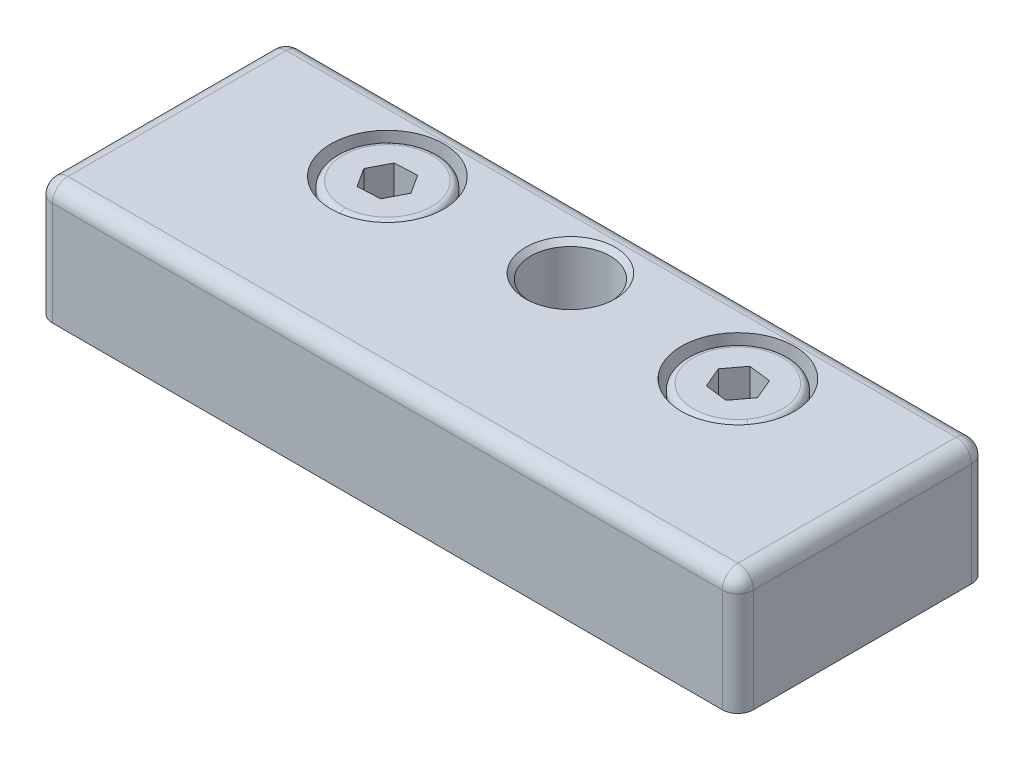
ISO-10303-21;
HEADER;
FILE_DESCRIPTION(('STEP AP214'),'2;1');
FILE_NAME('part.step','',(''),(''),'','','');
FILE_SCHEMA(('AUTOMOTIVE_DESIGN { 1 0 10303 214 1 1 1 1 }'));
ENDSEC;
DATA;
#1=APPLICATION_CONTEXT('core data for automotive mechanical design processes');
#2=APPLICATION_PROTOCOL_DEFINITION('international standard','automotive_design',2000,#1);
#3=PRODUCT_CONTEXT('',#1,'mechanical');
#4=PRODUCT('Part','Part','',(#3));
#5=PRODUCT_RELATED_PRODUCT_CATEGORY('part','',(#4));
#6=PRODUCT_DEFINITION_FORMATION('','',#4);
#7=PRODUCT_DEFINITION_CONTEXT('part definition',#1,'design');
#8=PRODUCT_DEFINITION('design','',#6,#7);
#9=PRODUCT_DEFINITION_SHAPE('','',#8);
#10=(LENGTH_UNIT() NAMED_UNIT(*) SI_UNIT(.MILLI.,.METRE.));
#11=(NAMED_UNIT(*) PLANE_ANGLE_UNIT() SI_UNIT($,.RADIAN.));
#12=(NAMED_UNIT(*) SI_UNIT($,.STERADIAN.) SOLID_ANGLE_UNIT());
#13=UNCERTAINTY_MEASURE_WITH_UNIT(LENGTH_MEASURE(1.E-05),#10,'distance_accuracy_value','');
#14=(GEOMETRIC_REPRESENTATION_CONTEXT(3) GLOBAL_UNCERTAINTY_ASSIGNED_CONTEXT((#13)) GLOBAL_UNIT_ASSIGNED_CONTEXT((#10,
#11,#12)) REPRESENTATION_CONTEXT('',''));
#15=CARTESIAN_POINT('',(0.,0.,0.));
#16=DIRECTION('',(0.,0.,1.));
#17=DIRECTION('',(1.,0.,0.));
#18=AXIS2_PLACEMENT_3D('',#15,#16,#17);
#19=CARTESIAN_POINT('',(-13.9296580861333,1.17542618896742,-9.5450792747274));
#20=DIRECTION('',(0.,1.,0.));
#21=DIRECTION('',(0.0476073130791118,0.,0.998866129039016));
#22=AXIS2_PLACEMENT_3D('',#19,#20,#21);
#23=CONICAL_SURFACE('',#22,2.5,1.0471975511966);
#24=DIRECTION('',(-0.0412291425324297,0.5,-0.865043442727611));
#25=VECTOR('',#24,1.);
#26=CARTESIAN_POINT('',(-14.048676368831,1.17542618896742,-12.0422445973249));
#27=LINE('',#26,#25);
#28=CARTESIAN_POINT('',(-13.9296580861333,-0.267949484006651,-9.5450792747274));
#29=VERTEX_POINT('',#28);
#30=CARTESIAN_POINT('',(-14.048676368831,1.17542618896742,-12.0422445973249));
#31=VERTEX_POINT('',#30);
#32=EDGE_CURVE('P0_E333',#29,#31,#27,.T.);
#33=ORIENTED_EDGE('',*,*,#32,.F.);
#34=DIRECTION('',(0.04122914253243,0.5,0.865043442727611));
#35=VECTOR('',#34,1.);
#36=CARTESIAN_POINT('',(-13.8106398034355,1.17542618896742,-7.04791395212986));
#37=LINE('',#36,#35);
#38=CARTESIAN_POINT('',(-13.8106398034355,1.17542618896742,-7.04791395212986));
#39=VERTEX_POINT('',#38);
#40=EDGE_CURVE('P0_E336',#29,#39,#37,.T.);
#41=ORIENTED_EDGE('',*,*,#40,.T.);
#42=CARTESIAN_POINT('',(-13.9296580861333,1.17542618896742,-9.5450792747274));
#43=DIRECTION('',(0.,1.,0.));
#44=DIRECTION('',(0.0476073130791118,0.,0.998866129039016));
#45=AXIS2_PLACEMENT_3D('',#42,#43,#44);
#46=CIRCLE('',#45,2.5);
#47=CARTESIAN_POINT('',(-11.7075403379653,1.17542618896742,-8.39956946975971));
#48=VERTEX_POINT('',#47);
#49=EDGE_CURVE('P0_E10',#39,#48,#46,.T.);
#50=ORIENTED_EDGE('',*,*,#49,.T.);
#51=CARTESIAN_POINT('',(-13.9296580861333,1.17542618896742,-9.5450792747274));
#52=DIRECTION('',(0.,1.,0.));
#53=DIRECTION('',(0.0476073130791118,0.,0.998866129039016));
#54=AXIS2_PLACEMENT_3D('',#51,#52,#53);
#55=CIRCLE('',#54,2.5);
#56=CARTESIAN_POINT('',(-11.8265586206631,1.17542618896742,-10.8967347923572));
#57=VERTEX_POINT('',#56);
#58=EDGE_CURVE('P0_E26',#48,#57,#55,.T.);
#59=ORIENTED_EDGE('',*,*,#58,.T.);
#60=CARTESIAN_POINT('',(-13.9296580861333,1.17542618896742,-9.5450792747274));
#61=DIRECTION('',(0.,1.,0.));
#62=DIRECTION('',(0.0476073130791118,0.,0.998866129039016));
#63=AXIS2_PLACEMENT_3D('',#60,#61,#62);
#64=CIRCLE('',#63,2.5);
#65=EDGE_CURVE('P0_E19',#57,#31,#64,.T.);
#66=ORIENTED_EDGE('',*,*,#65,.T.);
#67=EDGE_LOOP('',(#33,#41,#50,#59,#66));
#68=FACE_BOUND('',#67,.T.);
#69=ADVANCED_FACE('P0_F16',(#68),#23,.F.);
#70=CARTESIAN_POINT('',(-12.3689007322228,1.17542618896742,-7.11662918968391));
#71=DIRECTION('',(0.,1.,0.));
#72=DIRECTION('',(0.0476073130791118,0.,0.998866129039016));
#73=AXIS2_PLACEMENT_3D('',#70,#71,#72);
#74=PLANE('',#73);
#75=ORIENTED_EDGE('',*,*,#49,.F.);
#76=DIRECTION('',(0.998866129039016,0.,-0.0476073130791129));
#77=VECTOR('',#76,1.);
#78=CARTESIAN_POINT('',(-15.2523788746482,1.17542618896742,-6.97919871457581));
#79=LINE('',#78,#77);
#80=CARTESIAN_POINT('',(-12.3689007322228,1.17542618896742,-7.11662918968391));
#81=VERTEX_POINT('',#80);
#82=EDGE_CURVE('P0_E294',#39,#81,#79,.T.);
#83=ORIENTED_EDGE('',*,*,#82,.T.);
#84=DIRECTION('',(-0.458203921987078,0.,0.88884709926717));
#85=VECTOR('',#84,1.);
#86=CARTESIAN_POINT('',(-11.0461799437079,1.17542618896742,-9.68250974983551));
#87=LINE('',#86,#85);
#88=EDGE_CURVE('P0_E275',#48,#81,#87,.T.);
#89=ORIENTED_EDGE('',*,*,#88,.F.);
#90=EDGE_LOOP('',(#75,#83,#89));
#91=FACE_BOUND('',#90,.T.);
#92=ADVANCED_FACE('P0_F598',(#91),#74,.T.);
#93=CARTESIAN_POINT('',(-12.3689007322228,1.17542618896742,-7.11662918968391));
#94=DIRECTION('',(0.,1.,0.));
#95=DIRECTION('',(0.0476073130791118,0.,0.998866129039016));
#96=AXIS2_PLACEMENT_3D('',#93,#94,#95);
#97=PLANE('',#96);
#98=ORIENTED_EDGE('',*,*,#58,.F.);
#99=DIRECTION('',(-0.458203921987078,0.,0.88884709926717));
#100=VECTOR('',#99,1.);
#101=CARTESIAN_POINT('',(-11.0461799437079,1.17542618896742,-9.68250974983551));
#102=LINE('',#101,#100);
#103=CARTESIAN_POINT('',(-11.0461799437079,1.17542618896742,-9.68250974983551));
#104=VERTEX_POINT('',#103);
#105=EDGE_CURVE('P0_E271',#104,#48,#102,.T.);
#106=ORIENTED_EDGE('',*,*,#105,.F.);
#107=DIRECTION('',(-0.540662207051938,0.,-0.841239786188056));
#108=VECTOR('',#107,1.);
#109=CARTESIAN_POINT('',(-11.0461799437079,1.17542618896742,-9.68250974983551));
#110=LINE('',#109,#108);
#111=EDGE_CURVE('P0_E207',#104,#57,#110,.T.);
#112=ORIENTED_EDGE('',*,*,#111,.T.);
#113=EDGE_LOOP('',(#98,#106,#112));
#114=FACE_BOUND('',#113,.T.);
#115=ADVANCED_FACE('P0_F599',(#114),#97,.T.);
#116=CARTESIAN_POINT('',(-12.3689007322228,1.17542618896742,-7.11662918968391));
#117=DIRECTION('',(0.,1.,0.));
#118=DIRECTION('',(0.0476073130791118,0.,0.998866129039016));
#119=AXIS2_PLACEMENT_3D('',#116,#117,#118);
#120=PLANE('',#119);
#121=ORIENTED_EDGE('',*,*,#65,.F.);
#122=DIRECTION('',(-0.540662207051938,0.,-0.841239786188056));
#123=VECTOR('',#122,1.);
#124=CARTESIAN_POINT('',(-11.0461799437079,1.17542618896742,-9.68250974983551));
#125=LINE('',#124,#123);
#126=CARTESIAN_POINT('',(-12.6069372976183,1.17542618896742,-12.110959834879));
#127=VERTEX_POINT('',#126);
#128=EDGE_CURVE('P0_E205',#57,#127,#125,.T.);
#129=ORIENTED_EDGE('',*,*,#128,.T.);
#130=DIRECTION('',(-0.998866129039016,0.,0.0476073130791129));
#131=VECTOR('',#130,1.);
#132=CARTESIAN_POINT('',(-12.6069372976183,1.17542618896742,-12.110959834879));
#133=LINE('',#132,#131);
#134=EDGE_CURVE('P0_E175',#127,#31,#133,.T.);
#135=ORIENTED_EDGE('',*,*,#134,.T.);
#136=EDGE_LOOP('',(#121,#129,#135));
#137=FACE_BOUND('',#136,.T.);
#138=ADVANCED_FACE('P0_F609',(#137),#120,.T.);
#139=CARTESIAN_POINT('',(-12.3689007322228,1.17542618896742,-7.11662918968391));
#140=DIRECTION('',(0.,1.,0.));
#141=DIRECTION('',(0.0476073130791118,0.,0.998866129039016));
#142=AXIS2_PLACEMENT_3D('',#139,#140,#141);
#143=PLANE('',#142);
#144=CARTESIAN_POINT('',(-13.9296580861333,1.17542618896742,-9.5450792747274));
#145=DIRECTION('',(0.,1.,0.));
#146=DIRECTION('',(0.0476073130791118,0.,0.998866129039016));
#147=AXIS2_PLACEMENT_3D('',#144,#145,#146);
#148=CIRCLE('',#147,2.5);
#149=CARTESIAN_POINT('',(-16.1517758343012,1.17542618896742,-10.6905890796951));
#150=VERTEX_POINT('',#149);
#151=EDGE_CURVE('P0_E170',#31,#150,#148,.T.);
#152=ORIENTED_EDGE('',*,*,#151,.F.);
#153=DIRECTION('',(-0.998866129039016,0.,0.0476073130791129));
#154=VECTOR('',#153,1.);
#155=CARTESIAN_POINT('',(-12.6069372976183,1.17542618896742,-12.110959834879));
#156=LINE('',#155,#154);
#157=CARTESIAN_POINT('',(-15.4904154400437,1.17542618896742,-11.9735293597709));
#158=VERTEX_POINT('',#157);
#159=EDGE_CURVE('P0_E163',#31,#158,#156,.T.);
#160=ORIENTED_EDGE('',*,*,#159,.T.);
#161=DIRECTION('',(0.458203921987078,0.,-0.88884709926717));
#162=VECTOR('',#161,1.);
#163=CARTESIAN_POINT('',(-16.8131362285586,1.17542618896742,-9.4076487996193));
#164=LINE('',#163,#162);
#165=EDGE_CURVE('P0_E167',#150,#158,#164,.T.);
#166=ORIENTED_EDGE('',*,*,#165,.F.);
#167=EDGE_LOOP('',(#152,#160,#166));
#168=FACE_BOUND('',#167,.T.);
#169=ADVANCED_FACE('P0_F165',(#168),#143,.T.);
#170=CARTESIAN_POINT('',(-12.3689007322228,1.17542618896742,-7.11662918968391));
#171=DIRECTION('',(0.,1.,0.));
#172=DIRECTION('',(0.0476073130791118,0.,0.998866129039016));
#173=AXIS2_PLACEMENT_3D('',#170,#171,#172);
#174=PLANE('',#173);
#175=CARTESIAN_POINT('',(-13.9296580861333,1.17542618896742,-9.5450792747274));
#176=DIRECTION('',(0.,1.,0.));
#177=DIRECTION('',(0.0476073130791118,0.,0.998866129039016));
#178=AXIS2_PLACEMENT_3D('',#175,#176,#177);
#179=CIRCLE('',#178,2.5);
#180=CARTESIAN_POINT('',(-16.0327575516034,1.17542618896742,-8.19342375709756));
#181=VERTEX_POINT('',#180);
#182=EDGE_CURVE('P0_E317',#150,#181,#179,.T.);
#183=ORIENTED_EDGE('',*,*,#182,.F.);
#184=DIRECTION('',(0.458203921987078,0.,-0.88884709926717));
#185=VECTOR('',#184,1.);
#186=CARTESIAN_POINT('',(-16.8131362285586,1.17542618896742,-9.4076487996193));
#187=LINE('',#186,#185);
#188=CARTESIAN_POINT('',(-16.8131362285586,1.17542618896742,-9.4076487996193));
#189=VERTEX_POINT('',#188);
#190=EDGE_CURVE('P0_E189',#189,#150,#187,.T.);
#191=ORIENTED_EDGE('',*,*,#190,.F.);
#192=DIRECTION('',(-0.540662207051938,0.,-0.841239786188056));
#193=VECTOR('',#192,1.);
#194=CARTESIAN_POINT('',(-15.2523788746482,1.17542618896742,-6.97919871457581));
#195=LINE('',#194,#193);
#196=EDGE_CURVE('P0_E291',#181,#189,#195,.T.);
#197=ORIENTED_EDGE('',*,*,#196,.F.);
#198=EDGE_LOOP('',(#183,#191,#197));
#199=FACE_BOUND('',#198,.T.);
#200=ADVANCED_FACE('P0_F315',(#199),#174,.T.);
#201=CARTESIAN_POINT('',(-12.3689007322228,1.17542618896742,-7.11662918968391));
#202=DIRECTION('',(0.,1.,0.));
#203=DIRECTION('',(0.0476073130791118,0.,0.998866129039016));
#204=AXIS2_PLACEMENT_3D('',#201,#202,#203);
#205=PLANE('',#204);
#206=CARTESIAN_POINT('',(-13.9296580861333,1.17542618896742,-9.5450792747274));
#207=DIRECTION('',(0.,1.,0.));
#208=DIRECTION('',(0.0476073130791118,0.,0.998866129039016));
#209=AXIS2_PLACEMENT_3D('',#206,#207,#208);
#210=CIRCLE('',#209,2.5);
#211=EDGE_CURVE('P0_E344',#181,#39,#210,.T.);
#212=ORIENTED_EDGE('',*,*,#211,.F.);
#213=DIRECTION('',(-0.540662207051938,0.,-0.841239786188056));
#214=VECTOR('',#213,1.);
#215=CARTESIAN_POINT('',(-15.2523788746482,1.17542618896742,-6.97919871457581));
#216=LINE('',#215,#214);
#217=CARTESIAN_POINT('',(-15.2523788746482,1.17542618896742,-6.97919871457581));
#218=VERTEX_POINT('',#217);
#219=EDGE_CURVE('P0_E302',#218,#181,#216,.T.);
#220=ORIENTED_EDGE('',*,*,#219,.F.);
#221=DIRECTION('',(0.998866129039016,0.,-0.0476073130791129));
#222=VECTOR('',#221,1.);
#223=CARTESIAN_POINT('',(-15.2523788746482,1.17542618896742,-6.97919871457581));
#224=LINE('',#223,#222);
#225=EDGE_CURVE('P0_E297',#218,#39,#224,.T.);
#226=ORIENTED_EDGE('',*,*,#225,.T.);
#227=EDGE_LOOP('',(#212,#220,#226));
#228=FACE_BOUND('',#227,.T.);
#229=ADVANCED_FACE('P0_F590',(#228),#205,.T.);
#230=CARTESIAN_POINT('',(-11.0461799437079,1.17542618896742,-9.68250974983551));
#231=DIRECTION('',(0.841239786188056,0.,-0.540662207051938));
#232=DIRECTION('',(0.,1.,0.));
#233=AXIS2_PLACEMENT_3D('',#230,#231,#232);
#234=PLANE('',#233);
#235=DIRECTION('',(-0.540662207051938,0.,-0.841239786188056));
#236=VECTOR('',#235,1.);
#237=CARTESIAN_POINT('',(-11.0461799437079,4.97542618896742,-9.68250974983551));
#238=LINE('',#237,#236);
#239=CARTESIAN_POINT('',(-11.0461799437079,4.97542618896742,-9.68250974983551));
#240=VERTEX_POINT('',#239);
#241=CARTESIAN_POINT('',(-12.6069372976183,4.97542618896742,-12.110959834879));
#242=VERTEX_POINT('',#241);
#243=EDGE_CURVE('P0_E260',#240,#242,#238,.T.);
#244=ORIENTED_EDGE('',*,*,#243,.T.);
#245=DIRECTION('',(0.,1.,0.));
#246=VECTOR('',#245,1.);
#247=CARTESIAN_POINT('',(-12.6069372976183,1.17542618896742,-12.110959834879));
#248=LINE('',#247,#246);
#249=EDGE_CURVE('P0_E203',#127,#242,#248,.T.);
#250=ORIENTED_EDGE('',*,*,#249,.F.);
#251=ORIENTED_EDGE('',*,*,#128,.F.);
#252=ORIENTED_EDGE('',*,*,#111,.F.);
#253=DIRECTION('',(0.,1.,0.));
#254=VECTOR('',#253,1.);
#255=CARTESIAN_POINT('',(-11.0461799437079,1.17542618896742,-9.68250974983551));
#256=LINE('',#255,#254);
#257=EDGE_CURVE('P0_E276',#104,#240,#256,.T.);
#258=ORIENTED_EDGE('',*,*,#257,.T.);
#259=EDGE_LOOP('',(#244,#250,#251,#252,#258));
#260=FACE_BOUND('',#259,.T.);
#261=ADVANCED_FACE('P0_F606',(#260),#234,.F.);
#262=CARTESIAN_POINT('',(-12.6069372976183,1.17542618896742,-12.110959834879));
#263=DIRECTION('',(-0.0476073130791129,0.,-0.998866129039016));
#264=DIRECTION('',(-0.998866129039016,0.,0.0476073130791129));
#265=AXIS2_PLACEMENT_3D('',#262,#263,#264);
#266=PLANE('',#265);
#267=DIRECTION('',(-0.998866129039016,0.,0.0476073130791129));
#268=VECTOR('',#267,1.);
#269=CARTESIAN_POINT('',(-12.6069372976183,4.97542618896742,-12.110959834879));
#270=LINE('',#269,#268);
#271=CARTESIAN_POINT('',(-15.4904154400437,4.97542618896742,-11.9735293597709));
#272=VERTEX_POINT('',#271);
#273=EDGE_CURVE('P0_E181',#242,#272,#270,.T.);
#274=ORIENTED_EDGE('',*,*,#273,.T.);
#275=DIRECTION('',(0.,1.,0.));
#276=VECTOR('',#275,1.);
#277=CARTESIAN_POINT('',(-15.4904154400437,1.17542618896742,-11.9735293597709));
#278=LINE('',#277,#276);
#279=EDGE_CURVE('P0_E176',#158,#272,#278,.T.);
#280=ORIENTED_EDGE('',*,*,#279,.F.);
#281=ORIENTED_EDGE('',*,*,#159,.F.);
#282=ORIENTED_EDGE('',*,*,#134,.F.);
#283=ORIENTED_EDGE('',*,*,#249,.T.);
#284=EDGE_LOOP('',(#274,#280,#281,#282,#283));
#285=FACE_BOUND('',#284,.T.);
#286=ADVANCED_FACE('P0_F179',(#285),#266,.F.);
#287=CARTESIAN_POINT('',(-16.8131362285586,1.17542618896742,-9.4076487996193));
#288=DIRECTION('',(0.88884709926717,0.,0.458203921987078));
#289=DIRECTION('',(0.,-1.,0.));
#290=AXIS2_PLACEMENT_3D('',#287,#288,#289);
#291=PLANE('',#290);
#292=DIRECTION('',(0.458203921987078,0.,-0.88884709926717));
#293=VECTOR('',#292,1.);
#294=CARTESIAN_POINT('',(-16.8131362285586,4.97542618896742,-9.4076487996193));
#295=LINE('',#294,#293);
#296=CARTESIAN_POINT('',(-16.8131362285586,4.97542618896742,-9.4076487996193));
#297=VERTEX_POINT('',#296);
#298=EDGE_CURVE('P0_E254',#297,#272,#295,.T.);
#299=ORIENTED_EDGE('',*,*,#298,.F.);
#300=DIRECTION('',(0.,1.,0.));
#301=VECTOR('',#300,1.);
#302=CARTESIAN_POINT('',(-16.8131362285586,1.17542618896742,-9.4076487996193));
#303=LINE('',#302,#301);
#304=EDGE_CURVE('P0_E197',#189,#297,#303,.T.);
#305=ORIENTED_EDGE('',*,*,#304,.F.);
#306=ORIENTED_EDGE('',*,*,#190,.T.);
#307=ORIENTED_EDGE('',*,*,#165,.T.);
#308=ORIENTED_EDGE('',*,*,#279,.T.);
#309=EDGE_LOOP('',(#299,#305,#306,#307,#308));
#310=FACE_BOUND('',#309,.T.);
#311=ADVANCED_FACE('P0_F187',(#310),#291,.T.);
#312=CARTESIAN_POINT('',(-15.2523788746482,1.17542618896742,-6.97919871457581));
#313=DIRECTION('',(0.841239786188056,0.,-0.540662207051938));
#314=DIRECTION('',(0.,1.,0.));
#315=AXIS2_PLACEMENT_3D('',#312,#313,#314);
#316=PLANE('',#315);
#317=DIRECTION('',(-0.540662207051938,0.,-0.841239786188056));
#318=VECTOR('',#317,1.);
#319=CARTESIAN_POINT('',(-15.2523788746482,4.97542618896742,-6.97919871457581));
#320=LINE('',#319,#318);
#321=CARTESIAN_POINT('',(-15.2523788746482,4.97542618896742,-6.97919871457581));
#322=VERTEX_POINT('',#321);
#323=EDGE_CURVE('P0_E257',#322,#297,#320,.T.);
#324=ORIENTED_EDGE('',*,*,#323,.F.);
#325=DIRECTION('',(0.,1.,0.));
#326=VECTOR('',#325,1.);
#327=CARTESIAN_POINT('',(-15.2523788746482,1.17542618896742,-6.97919871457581));
#328=LINE('',#327,#326);
#329=EDGE_CURVE('P0_E301',#218,#322,#328,.T.);
#330=ORIENTED_EDGE('',*,*,#329,.F.);
#331=ORIENTED_EDGE('',*,*,#219,.T.);
#332=ORIENTED_EDGE('',*,*,#196,.T.);
#333=ORIENTED_EDGE('',*,*,#304,.T.);
#334=EDGE_LOOP('',(#324,#330,#331,#332,#333));
#335=FACE_BOUND('',#334,.T.);
#336=ADVANCED_FACE('P0_F311',(#335),#316,.T.);
#337=CARTESIAN_POINT('',(-15.2523788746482,1.17542618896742,-6.97919871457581));
#338=DIRECTION('',(0.0476073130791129,0.,0.998866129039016));
#339=DIRECTION('',(-0.998866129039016,0.,0.0476073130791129));
#340=AXIS2_PLACEMENT_3D('',#337,#338,#339);
#341=PLANE('',#340);
#342=DIRECTION('',(0.998866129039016,0.,-0.0476073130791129));
#343=VECTOR('',#342,1.);
#344=CARTESIAN_POINT('',(-15.2523788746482,4.97542618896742,-6.97919871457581));
#345=LINE('',#344,#343);
#346=CARTESIAN_POINT('',(-12.3689007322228,4.97542618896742,-7.11662918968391));
#347=VERTEX_POINT('',#346);
#348=EDGE_CURVE('P0_E251',#322,#347,#345,.T.);
#349=ORIENTED_EDGE('',*,*,#348,.T.);
#350=DIRECTION('',(0.,1.,0.));
#351=VECTOR('',#350,1.);
#352=CARTESIAN_POINT('',(-12.3689007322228,1.17542618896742,-7.11662918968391));
#353=LINE('',#352,#351);
#354=EDGE_CURVE('P0_E288',#81,#347,#353,.T.);
#355=ORIENTED_EDGE('',*,*,#354,.F.);
#356=ORIENTED_EDGE('',*,*,#82,.F.);
#357=ORIENTED_EDGE('',*,*,#225,.F.);
#358=ORIENTED_EDGE('',*,*,#329,.T.);
#359=EDGE_LOOP('',(#349,#355,#356,#357,#358));
#360=FACE_BOUND('',#359,.T.);
#361=ADVANCED_FACE('P0_F595',(#360),#341,.F.);
#362=CARTESIAN_POINT('',(-11.0461799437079,1.17542618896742,-9.68250974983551));
#363=DIRECTION('',(-0.88884709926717,0.,-0.458203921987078));
#364=DIRECTION('',(0.458203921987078,0.,-0.88884709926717));
#365=AXIS2_PLACEMENT_3D('',#362,#363,#364);
#366=PLANE('',#365);
#367=DIRECTION('',(-0.458203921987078,0.,0.88884709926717));
#368=VECTOR('',#367,1.);
#369=CARTESIAN_POINT('',(-11.0461799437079,4.97542618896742,-9.68250974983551));
#370=LINE('',#369,#368);
#371=EDGE_CURVE('P0_E247',#240,#347,#370,.T.);
#372=ORIENTED_EDGE('',*,*,#371,.F.);
#373=ORIENTED_EDGE('',*,*,#257,.F.);
#374=ORIENTED_EDGE('',*,*,#105,.T.);
#375=ORIENTED_EDGE('',*,*,#88,.T.);
#376=ORIENTED_EDGE('',*,*,#354,.T.);
#377=EDGE_LOOP('',(#372,#373,#374,#375,#376));
#378=FACE_BOUND('',#377,.T.);
#379=ADVANCED_FACE('P0_F603',(#378),#366,.T.);
#380=CARTESIAN_POINT('',(-13.9296580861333,4.17542618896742,-9.5450792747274));
#381=DIRECTION('',(0.,1.,0.));
#382=DIRECTION('',(0.0476073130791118,0.,0.998866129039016));
#383=AXIS2_PLACEMENT_3D('',#380,#381,#382);
#384=TOROIDAL_SURFACE('',#383,5.7,0.8);
#385=CARTESIAN_POINT('',(-14.2010197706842,4.17542618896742,-15.2386162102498));
#386=DIRECTION('',(0.998866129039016,0.,-0.0476073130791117));
#387=DIRECTION('',(0.0476073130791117,0.,0.998866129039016));
#388=AXIS2_PLACEMENT_3D('',#385,#386,#387);
#389=CIRCLE('',#388,0.8);
#390=CARTESIAN_POINT('',(-14.2391056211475,4.17542618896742,-16.037709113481));
#391=VERTEX_POINT('',#390);
#392=CARTESIAN_POINT('',(-14.2010197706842,4.97542618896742,-15.2386162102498));
#393=VERTEX_POINT('',#392);
#394=EDGE_CURVE('P0_E343',#391,#393,#389,.T.);
#395=ORIENTED_EDGE('',*,*,#394,.F.);
#396=CARTESIAN_POINT('',(-13.9296580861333,4.17542618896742,-9.5450792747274));
#397=DIRECTION('',(0.,-1.,0.));
#398=DIRECTION('',(0.0476073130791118,0.,0.998866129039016));
#399=AXIS2_PLACEMENT_3D('',#396,#397,#398);
#400=CIRCLE('',#399,6.5);
#401=CARTESIAN_POINT('',(-13.620210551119,4.17542618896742,-3.0524494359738));
#402=VERTEX_POINT('',#401);
#403=EDGE_CURVE('P0_E267',#402,#391,#400,.T.);
#404=ORIENTED_EDGE('',*,*,#403,.F.);
#405=CARTESIAN_POINT('',(-13.6582964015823,4.17542618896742,-3.85154233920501));
#406=DIRECTION('',(-0.998866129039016,0.,0.0476073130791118));
#407=DIRECTION('',(-0.0476073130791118,0.,-0.998866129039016));
#408=AXIS2_PLACEMENT_3D('',#405,#406,#407);
#409=CIRCLE('',#408,0.8);
#410=CARTESIAN_POINT('',(-13.6582964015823,4.97542618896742,-3.85154233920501));
#411=VERTEX_POINT('',#410);
#412=EDGE_CURVE('P0_E362',#402,#411,#409,.T.);
#413=ORIENTED_EDGE('',*,*,#412,.T.);
#414=CARTESIAN_POINT('',(-13.9296580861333,4.97542618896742,-9.5450792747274));
#415=DIRECTION('',(0.,1.,0.));
#416=DIRECTION('',(0.0476073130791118,0.,0.998866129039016));
#417=AXIS2_PLACEMENT_3D('',#414,#415,#416);
#418=CIRCLE('',#417,5.7);
#419=EDGE_CURVE('P0_E244',#393,#411,#418,.T.);
#420=ORIENTED_EDGE('',*,*,#419,.F.);
#421=EDGE_LOOP('',(#395,#404,#413,#420));
#422=FACE_BOUND('',#421,.T.);
#423=ADVANCED_FACE('P0_F640',(#422),#384,.T.);
#424=CARTESIAN_POINT('',(-13.9296580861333,-0.424573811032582,-9.5450792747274));
#425=DIRECTION('',(0.,-1.,0.));
#426=DIRECTION('',(-0.0476073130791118,0.,-0.998866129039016));
#427=AXIS2_PLACEMENT_3D('',#424,#425,#426);
#428=TOROIDAL_SURFACE('',#427,4.39999999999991,0.4);
#429=CARTESIAN_POINT('',(-13.7201859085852,-0.42457381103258,-5.15006830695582));
#430=DIRECTION('',(0.998866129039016,0.,-0.0476073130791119));
#431=DIRECTION('',(0.0476073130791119,0.,0.998866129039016));
#432=AXIS2_PLACEMENT_3D('',#429,#430,#431);
#433=CIRCLE('',#432,0.4);
#434=CARTESIAN_POINT('',(-13.7392288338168,-0.42457381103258,-5.54961475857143));
#435=VERTEX_POINT('',#434);
#436=CARTESIAN_POINT('',(-13.7201859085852,-0.0245738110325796,-5.15006830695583));
#437=VERTEX_POINT('',#436);
#438=EDGE_CURVE('P0_E372',#435,#437,#433,.T.);
#439=ORIENTED_EDGE('',*,*,#438,.F.);
#440=CARTESIAN_POINT('',(-13.9296580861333,-0.424573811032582,-9.5450792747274));
#441=DIRECTION('',(0.,-1.,0.));
#442=DIRECTION('',(-0.0476073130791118,0.,-0.998866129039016));
#443=AXIS2_PLACEMENT_3D('',#440,#441,#442);
#444=CIRCLE('',#443,3.99999999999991);
#445=CARTESIAN_POINT('',(-14.1200873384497,-0.424573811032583,-13.5405437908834));
#446=VERTEX_POINT('',#445);
#447=EDGE_CURVE('P0_E227',#446,#435,#444,.T.);
#448=ORIENTED_EDGE('',*,*,#447,.F.);
#449=CARTESIAN_POINT('',(-14.1391302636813,-0.424573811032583,-13.940090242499));
#450=DIRECTION('',(-0.998866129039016,0.,0.0476073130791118));
#451=DIRECTION('',(-0.0476073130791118,0.,-0.998866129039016));
#452=AXIS2_PLACEMENT_3D('',#449,#450,#451);
#453=CIRCLE('',#452,0.4);
#454=CARTESIAN_POINT('',(-14.1391302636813,-0.0245738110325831,-13.940090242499));
#455=VERTEX_POINT('',#454);
#456=EDGE_CURVE('P0_E354',#446,#455,#453,.T.);
#457=ORIENTED_EDGE('',*,*,#456,.T.);
#458=CARTESIAN_POINT('',(-13.9296580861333,-0.0245738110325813,-9.5450792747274));
#459=DIRECTION('',(0.,1.,0.));
#460=DIRECTION('',(-0.0476073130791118,0.,-0.998866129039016));
#461=AXIS2_PLACEMENT_3D('',#458,#459,#460);
#462=CIRCLE('',#461,4.39999999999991);
#463=EDGE_CURVE('P0_E270',#437,#455,#462,.T.);
#464=ORIENTED_EDGE('',*,*,#463,.F.);
#465=EDGE_LOOP('',(#439,#448,#457,#464));
#466=FACE_BOUND('',#465,.T.);
#467=ADVANCED_FACE('P0_F643',(#466),#428,.F.);
#468=CARTESIAN_POINT('',(-10.6239106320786,-25.0245738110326,-9.70263567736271));
#469=DIRECTION('',(0.,-1.,0.));
#470=DIRECTION('',(0.998866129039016,0.,-0.0476073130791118));
#471=AXIS2_PLACEMENT_3D('',#468,#469,#470);
#472=PLANE('',#471);
#473=CARTESIAN_POINT('',(-13.9296580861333,-25.0245738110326,-9.54507927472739));
#474=DIRECTION('',(0.,1.,0.));
#475=DIRECTION('',(0.0476073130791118,0.,0.998866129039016));
#476=AXIS2_PLACEMENT_3D('',#473,#474,#475);
#477=CIRCLE('',#476,3.3095);
#478=CARTESIAN_POINT('',(-13.7721016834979,-25.0245738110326,-6.23933182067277));
#479=VERTEX_POINT('',#478);
#480=CARTESIAN_POINT('',(-14.0872144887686,-25.0245738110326,-12.850826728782));
#481=VERTEX_POINT('',#480);
#482=EDGE_CURVE('P0_E350',#479,#481,#477,.T.);
#483=ORIENTED_EDGE('',*,*,#482,.F.);
#484=CARTESIAN_POINT('',(-13.9296580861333,-25.0245738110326,-9.54507927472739));
#485=DIRECTION('',(0.,1.,0.));
#486=DIRECTION('',(0.0476073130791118,0.,0.998866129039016));
#487=AXIS2_PLACEMENT_3D('',#484,#485,#486);
#488=CIRCLE('',#487,3.3095);
#489=EDGE_CURVE('P0_E280',#481,#479,#488,.T.);
#490=ORIENTED_EDGE('',*,*,#489,.F.);
#491=EDGE_LOOP('',(#483,#490));
#492=FACE_BOUND('',#491,.T.);
#493=ADVANCED_FACE('P0_F649',(#492),#472,.T.);
#494=CARTESIAN_POINT('',(-13.9296580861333,-25.0245738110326,-9.54507927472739));
#495=DIRECTION('',(0.,1.,0.));
#496=DIRECTION('',(0.0476073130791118,0.,0.998866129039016));
#497=AXIS2_PLACEMENT_3D('',#494,#495,#496);
#498=CONICAL_SURFACE('',#497,3.3095,0.785398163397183);
#499=DIRECTION('',(-0.0336634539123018,0.707106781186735,-0.706305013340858));
#500=VECTOR('',#499,1.);
#501=CARTESIAN_POINT('',(-14.0872144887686,-25.0245738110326,-12.850826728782));
#502=LINE('',#501,#500);
#503=CARTESIAN_POINT('',(-14.1200873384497,-24.3340738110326,-13.5405437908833));
#504=VERTEX_POINT('',#503);
#505=EDGE_CURVE('P0_E345',#481,#504,#502,.T.);
#506=ORIENTED_EDGE('',*,*,#505,.F.);
#507=ORIENTED_EDGE('',*,*,#489,.T.);
#508=DIRECTION('',(0.0336634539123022,0.707106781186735,0.706305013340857));
#509=VECTOR('',#508,1.);
#510=CARTESIAN_POINT('',(-13.7721016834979,-25.0245738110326,-6.23933182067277));
#511=LINE('',#510,#509);
#512=CARTESIAN_POINT('',(-13.7392288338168,-24.3340738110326,-5.54961475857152));
#513=VERTEX_POINT('',#512);
#514=EDGE_CURVE('P0_E384',#479,#513,#511,.T.);
#515=ORIENTED_EDGE('',*,*,#514,.T.);
#516=CARTESIAN_POINT('',(-13.9296580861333,-24.3340738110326,-9.54507927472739));
#517=DIRECTION('',(0.,1.,0.));
#518=DIRECTION('',(0.0476073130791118,0.,0.998866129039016));
#519=AXIS2_PLACEMENT_3D('',#516,#517,#518);
#520=CIRCLE('',#519,3.99999999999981);
#521=EDGE_CURVE('P0_E277',#504,#513,#520,.T.);
#522=ORIENTED_EDGE('',*,*,#521,.F.);
#523=EDGE_LOOP('',(#506,#507,#515,#522));
#524=FACE_BOUND('',#523,.T.);
#525=ADVANCED_FACE('P0_F653',(#524),#498,.T.);
#526=CARTESIAN_POINT('',(-13.9296580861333,36.7254261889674,-9.54507927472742));
#527=DIRECTION('',(0.,1.,0.));
#528=DIRECTION('',(0.0476073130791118,0.,0.998866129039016));
#529=AXIS2_PLACEMENT_3D('',#526,#527,#528);
#530=CYLINDRICAL_SURFACE('',#529,3.99999999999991);
#531=DIRECTION('',(0.,1.,0.));
#532=VECTOR('',#531,1.);
#533=CARTESIAN_POINT('',(-14.1200873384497,36.7254261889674,-13.5405437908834));
#534=LINE('',#533,#532);
#535=EDGE_CURVE('P0_E225',#504,#446,#534,.T.);
#536=ORIENTED_EDGE('',*,*,#535,.F.);
#537=ORIENTED_EDGE('',*,*,#521,.T.);
#538=DIRECTION('',(0.,1.,0.));
#539=VECTOR('',#538,1.);
#540=CARTESIAN_POINT('',(-13.7392288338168,36.7254261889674,-5.54961475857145));
#541=LINE('',#540,#539);
#542=EDGE_CURVE('P0_E231',#513,#435,#541,.T.);
#543=ORIENTED_EDGE('',*,*,#542,.T.);
#544=CARTESIAN_POINT('',(-13.9296580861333,-0.424573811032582,-9.5450792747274));
#545=DIRECTION('',(0.,-1.,0.));
#546=DIRECTION('',(-0.0476073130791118,0.,-0.998866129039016));
#547=AXIS2_PLACEMENT_3D('',#544,#545,#546);
#548=CIRCLE('',#547,3.99999999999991);
#549=EDGE_CURVE('P0_E366',#435,#446,#548,.T.);
#550=ORIENTED_EDGE('',*,*,#549,.T.);
#551=EDGE_LOOP('',(#536,#537,#543,#550));
#552=FACE_BOUND('',#551,.T.);
#553=ADVANCED_FACE('P0_F414',(#552),#530,.T.);
#554=CARTESIAN_POINT('',(-7.43702824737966,-0.0245738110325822,-9.85452680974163));
#555=DIRECTION('',(0.,-1.,0.));
#556=DIRECTION('',(0.998866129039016,0.,-0.0476073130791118));
#557=AXIS2_PLACEMENT_3D('',#554,#555,#556);
#558=PLANE('',#557);
#559=CARTESIAN_POINT('',(-13.9296580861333,-0.0245738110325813,-9.5450792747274));
#560=DIRECTION('',(0.,1.,0.));
#561=DIRECTION('',(-0.0476073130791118,0.,-0.998866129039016));
#562=AXIS2_PLACEMENT_3D('',#559,#560,#561);
#563=CIRCLE('',#562,4.39999999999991);
#564=EDGE_CURVE('P0_E376',#455,#437,#563,.T.);
#565=ORIENTED_EDGE('',*,*,#564,.T.);
#566=ORIENTED_EDGE('',*,*,#463,.T.);
#567=EDGE_LOOP('',(#565,#566));
#568=FACE_BOUND('',#567,.T.);
#569=CARTESIAN_POINT('',(-13.9296580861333,-0.0245738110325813,-9.5450792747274));
#570=DIRECTION('',(0.,1.,0.));
#571=DIRECTION('',(0.0476073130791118,0.,0.998866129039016));
#572=AXIS2_PLACEMENT_3D('',#569,#570,#571);
#573=CIRCLE('',#572,6.5);
#574=CARTESIAN_POINT('',(-13.620210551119,-0.0245738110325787,-3.0524494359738));
#575=VERTEX_POINT('',#574);
#576=CARTESIAN_POINT('',(-14.2391056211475,-0.0245738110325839,-16.037709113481));
#577=VERTEX_POINT('',#576);
#578=EDGE_CURVE('P0_E235',#575,#577,#573,.T.);
#579=ORIENTED_EDGE('',*,*,#578,.F.);
#580=CARTESIAN_POINT('',(-13.9296580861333,-0.0245738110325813,-9.5450792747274));
#581=DIRECTION('',(0.,1.,0.));
#582=DIRECTION('',(0.0476073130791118,0.,0.998866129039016));
#583=AXIS2_PLACEMENT_3D('',#580,#581,#582);
#584=CIRCLE('',#583,6.5);
#585=EDGE_CURVE('P0_E264',#577,#575,#584,.T.);
#586=ORIENTED_EDGE('',*,*,#585,.F.);
#587=EDGE_LOOP('',(#579,#586));
#588=FACE_BOUND('',#587,.T.);
#589=ADVANCED_FACE('P0_F659',(#568,#588),#558,.T.);
#590=CARTESIAN_POINT('',(-13.9296580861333,36.7254261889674,-9.54507927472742));
#591=DIRECTION('',(0.,1.,0.));
#592=DIRECTION('',(0.0476073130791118,0.,0.998866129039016));
#593=AXIS2_PLACEMENT_3D('',#590,#591,#592);
#594=CYLINDRICAL_SURFACE('',#593,6.5);
#595=DIRECTION('',(0.,1.,0.));
#596=VECTOR('',#595,1.);
#597=CARTESIAN_POINT('',(-14.2391056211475,36.7254261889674,-16.037709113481));
#598=LINE('',#597,#596);
#599=EDGE_CURVE('P0_E236',#577,#391,#598,.T.);
#600=ORIENTED_EDGE('',*,*,#599,.F.);
#601=ORIENTED_EDGE('',*,*,#585,.T.);
#602=DIRECTION('',(0.,1.,0.));
#603=VECTOR('',#602,1.);
#604=CARTESIAN_POINT('',(-13.620210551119,36.7254261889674,-3.05244943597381));
#605=LINE('',#604,#603);
#606=EDGE_CURVE('P0_E240',#575,#402,#605,.T.);
#607=ORIENTED_EDGE('',*,*,#606,.T.);
#608=ORIENTED_EDGE('',*,*,#403,.T.);
#609=EDGE_LOOP('',(#600,#601,#607,#608));
#610=FACE_BOUND('',#609,.T.);
#611=ADVANCED_FACE('P0_F662',(#610),#594,.T.);
#612=CARTESIAN_POINT('',(-13.9296580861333,4.97542618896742,-9.5450792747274));
#613=DIRECTION('',(0.,1.,0.));
#614=DIRECTION('',(0.0476073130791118,0.,0.998866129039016));
#615=AXIS2_PLACEMENT_3D('',#612,#613,#614);
#616=PLANE('',#615);
#617=ORIENTED_EDGE('',*,*,#371,.T.);
#618=ORIENTED_EDGE('',*,*,#348,.F.);
#619=ORIENTED_EDGE('',*,*,#323,.T.);
#620=ORIENTED_EDGE('',*,*,#298,.T.);
#621=ORIENTED_EDGE('',*,*,#273,.F.);
#622=ORIENTED_EDGE('',*,*,#243,.F.);
#623=EDGE_LOOP('',(#617,#618,#619,#620,#621,#622));
#624=FACE_BOUND('',#623,.T.);
#625=CARTESIAN_POINT('',(-13.9296580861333,4.97542618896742,-9.5450792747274));
#626=DIRECTION('',(0.,1.,0.));
#627=DIRECTION('',(0.0476073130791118,0.,0.998866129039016));
#628=AXIS2_PLACEMENT_3D('',#625,#626,#627);
#629=CIRCLE('',#628,5.7);
#630=EDGE_CURVE('P0_E358',#411,#393,#629,.T.);
#631=ORIENTED_EDGE('',*,*,#630,.T.);
#632=ORIENTED_EDGE('',*,*,#419,.T.);
#633=EDGE_LOOP('',(#631,#632));
#634=FACE_BOUND('',#633,.T.);
#635=ADVANCED_FACE('P0_F321',(#624,#634),#616,.T.);
#636=CARTESIAN_POINT('',(-13.9296580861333,36.7254261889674,-9.54507927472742));
#637=DIRECTION('',(0.,1.,0.));
#638=DIRECTION('',(0.0476073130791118,0.,0.998866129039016));
#639=AXIS2_PLACEMENT_3D('',#636,#637,#638);
#640=CYLINDRICAL_SURFACE('',#639,6.5);
#641=ORIENTED_EDGE('',*,*,#578,.T.);
#642=ORIENTED_EDGE('',*,*,#599,.T.);
#643=CARTESIAN_POINT('',(-13.9296580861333,4.17542618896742,-9.5450792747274));
#644=DIRECTION('',(0.,-1.,0.));
#645=DIRECTION('',(0.0476073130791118,0.,0.998866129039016));
#646=AXIS2_PLACEMENT_3D('',#643,#644,#645);
#647=CIRCLE('',#646,6.5);
#648=EDGE_CURVE('P0_E339',#391,#402,#647,.T.);
#649=ORIENTED_EDGE('',*,*,#648,.T.);
#650=ORIENTED_EDGE('',*,*,#606,.F.);
#651=EDGE_LOOP('',(#641,#642,#649,#650));
#652=FACE_BOUND('',#651,.T.);
#653=ADVANCED_FACE('P0_F669',(#652),#640,.T.);
#654=CARTESIAN_POINT('',(-13.9296580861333,36.7254261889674,-9.54507927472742));
#655=DIRECTION('',(0.,1.,0.));
#656=DIRECTION('',(0.0476073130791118,0.,0.998866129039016));
#657=AXIS2_PLACEMENT_3D('',#654,#655,#656);
#658=CYLINDRICAL_SURFACE('',#657,3.99999999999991);
#659=CARTESIAN_POINT('',(-13.9296580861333,-24.3340738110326,-9.54507927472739));
#660=DIRECTION('',(0.,1.,0.));
#661=DIRECTION('',(0.0476073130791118,0.,0.998866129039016));
#662=AXIS2_PLACEMENT_3D('',#659,#660,#661);
#663=CIRCLE('',#662,3.99999999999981);
#664=EDGE_CURVE('P0_E349',#513,#504,#663,.T.);
#665=ORIENTED_EDGE('',*,*,#664,.T.);
#666=ORIENTED_EDGE('',*,*,#535,.T.);
#667=ORIENTED_EDGE('',*,*,#447,.T.);
#668=ORIENTED_EDGE('',*,*,#542,.F.);
#669=EDGE_LOOP('',(#665,#666,#667,#668));
#670=FACE_BOUND('',#669,.T.);
#671=ADVANCED_FACE('P0_F673',(#670),#658,.T.);
#672=CARTESIAN_POINT('',(-13.9296580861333,-25.0245738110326,-9.54507927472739));
#673=DIRECTION('',(0.,1.,0.));
#674=DIRECTION('',(0.0476073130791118,0.,0.998866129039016));
#675=AXIS2_PLACEMENT_3D('',#672,#673,#674);
#676=CONICAL_SURFACE('',#675,3.3095,0.785398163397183);
#677=ORIENTED_EDGE('',*,*,#482,.T.);
#678=ORIENTED_EDGE('',*,*,#505,.T.);
#679=ORIENTED_EDGE('',*,*,#664,.F.);
#680=ORIENTED_EDGE('',*,*,#514,.F.);
#681=EDGE_LOOP('',(#677,#678,#679,#680));
#682=FACE_BOUND('',#681,.T.);
#683=ADVANCED_FACE('P0_F670',(#682),#676,.T.);
#684=CARTESIAN_POINT('',(-13.9296580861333,-0.424573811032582,-9.5450792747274));
#685=DIRECTION('',(0.,-1.,0.));
#686=DIRECTION('',(-0.0476073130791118,0.,-0.998866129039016));
#687=AXIS2_PLACEMENT_3D('',#684,#685,#686);
#688=TOROIDAL_SURFACE('',#687,4.39999999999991,0.4);
#689=ORIENTED_EDGE('',*,*,#549,.F.);
#690=ORIENTED_EDGE('',*,*,#438,.T.);
#691=ORIENTED_EDGE('',*,*,#564,.F.);
#692=ORIENTED_EDGE('',*,*,#456,.F.);
#693=EDGE_LOOP('',(#689,#690,#691,#692));
#694=FACE_BOUND('',#693,.T.);
#695=ADVANCED_FACE('P0_F417',(#694),#688,.F.);
#696=CARTESIAN_POINT('',(-13.9296580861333,4.17542618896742,-9.5450792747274));
#697=DIRECTION('',(0.,1.,0.));
#698=DIRECTION('',(0.0476073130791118,0.,0.998866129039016));
#699=AXIS2_PLACEMENT_3D('',#696,#697,#698);
#700=TOROIDAL_SURFACE('',#699,5.7,0.8);
#701=ORIENTED_EDGE('',*,*,#648,.F.);
#702=ORIENTED_EDGE('',*,*,#394,.T.);
#703=ORIENTED_EDGE('',*,*,#630,.F.);
#704=ORIENTED_EDGE('',*,*,#412,.F.);
#705=EDGE_LOOP('',(#701,#702,#703,#704));
#706=FACE_BOUND('',#705,.T.);
#707=ADVANCED_FACE('P0_F680',(#706),#700,.T.);
#708=CARTESIAN_POINT('',(-13.9296580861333,1.17542618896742,-9.5450792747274));
#709=DIRECTION('',(0.,1.,0.));
#710=DIRECTION('',(0.0476073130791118,0.,0.998866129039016));
#711=AXIS2_PLACEMENT_3D('',#708,#709,#710);
#712=CONICAL_SURFACE('',#711,2.5,1.0471975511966);
#713=ORIENTED_EDGE('',*,*,#40,.F.);
#714=ORIENTED_EDGE('',*,*,#32,.T.);
#715=ORIENTED_EDGE('',*,*,#151,.T.);
#716=ORIENTED_EDGE('',*,*,#182,.T.);
#717=ORIENTED_EDGE('',*,*,#211,.T.);
#718=EDGE_LOOP('',(#713,#714,#715,#716,#717));
#719=FACE_BOUND('',#718,.T.);
#720=ADVANCED_FACE('P0_F588',(#719),#712,.F.);
#721=CLOSED_SHELL('',(#69,#92,#115,#138,#169,#200,#229,#261,#286,#311,#336,#361,#379,#423,#467,
#493,#525,#553,#589,#611,#635,#653,#671,#683,#695,#707,#720));
#722=MANIFOLD_SOLID_BREP('P0_B1',#721);
#723=CARTESIAN_POINT('',(31.0703419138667,1.17542618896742,-9.54507927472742));
#724=DIRECTION('',(0.,1.,0.));
#725=DIRECTION('',(0.799581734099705,0.,0.600557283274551));
#726=AXIS2_PLACEMENT_3D('',#723,#724,#725);
#727=CONICAL_SURFACE('',#726,2.5,1.0471975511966);
#728=DIRECTION('',(-0.692458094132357,0.5,-0.520097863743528));
#729=VECTOR('',#728,1.);
#730=CARTESIAN_POINT('',(29.0713875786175,1.17542618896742,-11.0464724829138));
#731=LINE('',#730,#729);
#732=CARTESIAN_POINT('',(31.0703419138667,-0.26794948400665,-9.54507927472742));
#733=VERTEX_POINT('',#732);
#734=CARTESIAN_POINT('',(29.0713875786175,1.17542618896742,-11.0464724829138));
#735=VERTEX_POINT('',#734);
#736=EDGE_CURVE('P1_E334',#733,#735,#731,.T.);
#737=ORIENTED_EDGE('',*,*,#736,.F.);
#738=DIRECTION('',(0.692458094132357,0.5,0.520097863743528));
#739=VECTOR('',#738,1.);
#740=CARTESIAN_POINT('',(33.069296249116,1.17542618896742,-8.04368606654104));
#741=LINE('',#740,#739);
#742=CARTESIAN_POINT('',(33.069296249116,1.17542618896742,-8.04368606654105));
#743=VERTEX_POINT('',#742);
#744=EDGE_CURVE('P1_E337',#733,#743,#741,.T.);
#745=ORIENTED_EDGE('',*,*,#744,.T.);
#746=CARTESIAN_POINT('',(31.0703419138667,1.17542618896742,-9.54507927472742));
#747=DIRECTION('',(0.,1.,0.));
#748=DIRECTION('',(0.799581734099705,0.,0.600557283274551));
#749=AXIS2_PLACEMENT_3D('',#746,#747,#748);
#750=CIRCLE('',#749,2.5);
#751=CARTESIAN_POINT('',(33.3700637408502,1.17542618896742,-10.5255279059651));
#752=VERTEX_POINT('',#751);
#753=EDGE_CURVE('P1_E11',#743,#752,#750,.T.);
#754=ORIENTED_EDGE('',*,*,#753,.T.);
#755=CARTESIAN_POINT('',(31.0703419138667,1.17542618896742,-9.54507927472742));
#756=DIRECTION('',(0.,1.,0.));
#757=DIRECTION('',(0.799581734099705,0.,0.600557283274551));
#758=AXIS2_PLACEMENT_3D('',#755,#756,#757);
#759=CIRCLE('',#758,2.5);
#760=CARTESIAN_POINT('',(31.3711094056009,1.17542618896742,-12.0269211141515));
#761=VERTEX_POINT('',#760);
#762=EDGE_CURVE('P1_E27',#752,#761,#759,.T.);
#763=ORIENTED_EDGE('',*,*,#762,.T.);
#764=CARTESIAN_POINT('',(31.0703419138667,1.17542618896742,-9.54507927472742));
#765=DIRECTION('',(0.,1.,0.));
#766=DIRECTION('',(0.799581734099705,0.,0.600557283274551));
#767=AXIS2_PLACEMENT_3D('',#764,#765,#766);
#768=CIRCLE('',#767,2.5);
#769=EDGE_CURVE('P1_E20',#761,#735,#768,.T.);
#770=ORIENTED_EDGE('',*,*,#769,.T.);
#771=EDGE_LOOP('',(#737,#745,#754,#763,#770));
#772=FACE_BOUND('',#771,.T.);
#773=ADVANCED_FACE('P1_F17',(#772),#727,.F.);
#774=CARTESIAN_POINT('',(33.9361260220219,1.17542618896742,-9.19778289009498));
#775=DIRECTION('',(0.,1.,0.));
#776=DIRECTION('',(0.799581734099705,0.,0.600557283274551));
#777=AXIS2_PLACEMENT_3D('',#774,#775,#776);
#778=PLANE('',#777);
#779=ORIENTED_EDGE('',*,*,#753,.F.);
#780=DIRECTION('',(0.60055728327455,0.,-0.799581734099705));
#781=VECTOR('',#780,1.);
#782=CARTESIAN_POINT('',(32.2024664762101,1.17542618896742,-6.88958924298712));
#783=LINE('',#782,#781);
#784=CARTESIAN_POINT('',(33.9361260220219,1.17542618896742,-9.19778289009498));
#785=VERTEX_POINT('',#784);
#786=EDGE_CURVE('P1_E295',#743,#785,#783,.T.);
#787=ORIENTED_EDGE('',*,*,#786,.T.);
#788=DIRECTION('',(0.392179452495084,0.,0.919888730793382));
#789=VECTOR('',#788,1.);
#790=CARTESIAN_POINT('',(32.8040014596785,1.17542618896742,-11.8532729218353));
#791=LINE('',#790,#789);
#792=EDGE_CURVE('P1_E276',#752,#785,#791,.T.);
#793=ORIENTED_EDGE('',*,*,#792,.F.);
#794=EDGE_LOOP('',(#779,#787,#793));
#795=FACE_BOUND('',#794,.T.);
#796=ADVANCED_FACE('P1_F599',(#795),#778,.T.);
#797=CARTESIAN_POINT('',(33.9361260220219,1.17542618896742,-9.19778289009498));
#798=DIRECTION('',(0.,1.,0.));
#799=DIRECTION('',(0.799581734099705,0.,0.600557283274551));
#800=AXIS2_PLACEMENT_3D('',#797,#798,#799);
#801=PLANE('',#800);
#802=ORIENTED_EDGE('',*,*,#762,.F.);
#803=DIRECTION('',(0.392179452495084,0.,0.919888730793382));
#804=VECTOR('',#803,1.);
#805=CARTESIAN_POINT('',(32.8040014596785,1.17542618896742,-11.8532729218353));
#806=LINE('',#805,#804);
#807=CARTESIAN_POINT('',(32.8040014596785,1.17542618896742,-11.8532729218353));
#808=VERTEX_POINT('',#807);
#809=EDGE_CURVE('P1_E272',#808,#752,#806,.T.);
#810=ORIENTED_EDGE('',*,*,#809,.F.);
#811=DIRECTION('',(-0.992736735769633,0.,-0.120306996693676));
#812=VECTOR('',#811,1.);
#813=CARTESIAN_POINT('',(32.8040014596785,1.17542618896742,-11.8532729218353));
#814=LINE('',#813,#812);
#815=EDGE_CURVE('P1_E208',#808,#761,#814,.T.);
#816=ORIENTED_EDGE('',*,*,#815,.T.);
#817=EDGE_LOOP('',(#802,#810,#816));
#818=FACE_BOUND('',#817,.T.);
#819=ADVANCED_FACE('P1_F600',(#818),#801,.T.);
#820=CARTESIAN_POINT('',(33.9361260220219,1.17542618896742,-9.19778289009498));
#821=DIRECTION('',(0.,1.,0.));
#822=DIRECTION('',(0.799581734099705,0.,0.600557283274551));
#823=AXIS2_PLACEMENT_3D('',#820,#821,#822);
#824=PLANE('',#823);
#825=ORIENTED_EDGE('',*,*,#769,.F.);
#826=DIRECTION('',(-0.992736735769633,0.,-0.120306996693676));
#827=VECTOR('',#826,1.);
#828=CARTESIAN_POINT('',(32.8040014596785,1.17542618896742,-11.8532729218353));
#829=LINE('',#828,#827);
#830=CARTESIAN_POINT('',(29.9382173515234,1.17542618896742,-12.2005693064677));
#831=VERTEX_POINT('',#830);
#832=EDGE_CURVE('P1_E206',#761,#831,#829,.T.);
#833=ORIENTED_EDGE('',*,*,#832,.T.);
#834=DIRECTION('',(-0.60055728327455,0.,0.799581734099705));
#835=VECTOR('',#834,1.);
#836=CARTESIAN_POINT('',(29.9382173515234,1.17542618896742,-12.2005693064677));
#837=LINE('',#836,#835);
#838=EDGE_CURVE('P1_E176',#831,#735,#837,.T.);
#839=ORIENTED_EDGE('',*,*,#838,.T.);
#840=EDGE_LOOP('',(#825,#833,#839));
#841=FACE_BOUND('',#840,.T.);
#842=ADVANCED_FACE('P1_F610',(#841),#824,.T.);
#843=CARTESIAN_POINT('',(33.9361260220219,1.17542618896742,-9.19778289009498));
#844=DIRECTION('',(0.,1.,0.));
#845=DIRECTION('',(0.799581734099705,0.,0.600557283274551));
#846=AXIS2_PLACEMENT_3D('',#843,#844,#845);
#847=PLANE('',#846);
#848=CARTESIAN_POINT('',(31.0703419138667,1.17542618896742,-9.54507927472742));
#849=DIRECTION('',(0.,1.,0.));
#850=DIRECTION('',(0.799581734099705,0.,0.600557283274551));
#851=AXIS2_PLACEMENT_3D('',#848,#849,#850);
#852=CIRCLE('',#851,2.5);
#853=CARTESIAN_POINT('',(28.7706200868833,1.17542618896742,-8.56463064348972));
#854=VERTEX_POINT('',#853);
#855=EDGE_CURVE('P1_E171',#735,#854,#852,.T.);
#856=ORIENTED_EDGE('',*,*,#855,.F.);
#857=DIRECTION('',(-0.60055728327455,0.,0.799581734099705));
#858=VECTOR('',#857,1.);
#859=CARTESIAN_POINT('',(29.9382173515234,1.17542618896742,-12.2005693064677));
#860=LINE('',#859,#858);
#861=CARTESIAN_POINT('',(28.2045578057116,1.17542618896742,-9.89237565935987));
#862=VERTEX_POINT('',#861);
#863=EDGE_CURVE('P1_E164',#735,#862,#860,.T.);
#864=ORIENTED_EDGE('',*,*,#863,.T.);
#865=DIRECTION('',(-0.392179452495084,0.,-0.919888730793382));
#866=VECTOR('',#865,1.);
#867=CARTESIAN_POINT('',(29.336682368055,1.17542618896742,-7.23688562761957));
#868=LINE('',#867,#866);
#869=EDGE_CURVE('P1_E168',#854,#862,#868,.T.);
#870=ORIENTED_EDGE('',*,*,#869,.F.);
#871=EDGE_LOOP('',(#856,#864,#870));
#872=FACE_BOUND('',#871,.T.);
#873=ADVANCED_FACE('P1_F166',(#872),#847,.T.);
#874=CARTESIAN_POINT('',(33.9361260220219,1.17542618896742,-9.19778289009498));
#875=DIRECTION('',(0.,1.,0.));
#876=DIRECTION('',(0.799581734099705,0.,0.600557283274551));
#877=AXIS2_PLACEMENT_3D('',#874,#875,#876);
#878=PLANE('',#877);
#879=CARTESIAN_POINT('',(31.0703419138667,1.17542618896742,-9.54507927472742));
#880=DIRECTION('',(0.,1.,0.));
#881=DIRECTION('',(0.799581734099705,0.,0.600557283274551));
#882=AXIS2_PLACEMENT_3D('',#879,#880,#881);
#883=CIRCLE('',#882,2.5);
#884=CARTESIAN_POINT('',(30.7695744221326,1.17542618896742,-7.06323743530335));
#885=VERTEX_POINT('',#884);
#886=EDGE_CURVE('P1_E318',#854,#885,#883,.T.);
#887=ORIENTED_EDGE('',*,*,#886,.F.);
#888=DIRECTION('',(-0.392179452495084,0.,-0.919888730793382));
#889=VECTOR('',#888,1.);
#890=CARTESIAN_POINT('',(29.336682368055,1.17542618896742,-7.23688562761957));
#891=LINE('',#890,#889);
#892=CARTESIAN_POINT('',(29.336682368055,1.17542618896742,-7.23688562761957));
#893=VERTEX_POINT('',#892);
#894=EDGE_CURVE('P1_E190',#893,#854,#891,.T.);
#895=ORIENTED_EDGE('',*,*,#894,.F.);
#896=DIRECTION('',(-0.992736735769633,0.,-0.120306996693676));
#897=VECTOR('',#896,1.);
#898=CARTESIAN_POINT('',(32.2024664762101,1.17542618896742,-6.88958924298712));
#899=LINE('',#898,#897);
#900=EDGE_CURVE('P1_E292',#885,#893,#899,.T.);
#901=ORIENTED_EDGE('',*,*,#900,.F.);
#902=EDGE_LOOP('',(#887,#895,#901));
#903=FACE_BOUND('',#902,.T.);
#904=ADVANCED_FACE('P1_F316',(#903),#878,.T.);
#905=CARTESIAN_POINT('',(33.9361260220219,1.17542618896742,-9.19778289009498));
#906=DIRECTION('',(0.,1.,0.));
#907=DIRECTION('',(0.799581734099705,0.,0.600557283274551));
#908=AXIS2_PLACEMENT_3D('',#905,#906,#907);
#909=PLANE('',#908);
#910=CARTESIAN_POINT('',(31.0703419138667,1.17542618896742,-9.54507927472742));
#911=DIRECTION('',(0.,1.,0.));
#912=DIRECTION('',(0.799581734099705,0.,0.600557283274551));
#913=AXIS2_PLACEMENT_3D('',#910,#911,#912);
#914=CIRCLE('',#913,2.5);
#915=EDGE_CURVE('P1_E345',#885,#743,#914,.T.);
#916=ORIENTED_EDGE('',*,*,#915,.F.);
#917=DIRECTION('',(-0.992736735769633,0.,-0.120306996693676));
#918=VECTOR('',#917,1.);
#919=CARTESIAN_POINT('',(32.2024664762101,1.17542618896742,-6.88958924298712));
#920=LINE('',#919,#918);
#921=CARTESIAN_POINT('',(32.2024664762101,1.17542618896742,-6.88958924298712));
#922=VERTEX_POINT('',#921);
#923=EDGE_CURVE('P1_E303',#922,#885,#920,.T.);
#924=ORIENTED_EDGE('',*,*,#923,.F.);
#925=DIRECTION('',(0.60055728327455,0.,-0.799581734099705));
#926=VECTOR('',#925,1.);
#927=CARTESIAN_POINT('',(32.2024664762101,1.17542618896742,-6.88958924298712));
#928=LINE('',#927,#926);
#929=EDGE_CURVE('P1_E298',#922,#743,#928,.T.);
#930=ORIENTED_EDGE('',*,*,#929,.T.);
#931=EDGE_LOOP('',(#916,#924,#930));
#932=FACE_BOUND('',#931,.T.);
#933=ADVANCED_FACE('P1_F591',(#932),#909,.T.);
#934=CARTESIAN_POINT('',(32.8040014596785,1.17542618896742,-11.8532729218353));
#935=DIRECTION('',(0.120306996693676,0.,-0.992736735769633));
#936=DIRECTION('',(0.,1.,0.));
#937=AXIS2_PLACEMENT_3D('',#934,#935,#936);
#938=PLANE('',#937);
#939=DIRECTION('',(-0.992736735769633,0.,-0.120306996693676));
#940=VECTOR('',#939,1.);
#941=CARTESIAN_POINT('',(32.8040014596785,4.97542618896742,-11.8532729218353));
#942=LINE('',#941,#940);
#943=CARTESIAN_POINT('',(32.8040014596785,4.97542618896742,-11.8532729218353));
#944=VERTEX_POINT('',#943);
#945=CARTESIAN_POINT('',(29.9382173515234,4.97542618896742,-12.2005693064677));
#946=VERTEX_POINT('',#945);
#947=EDGE_CURVE('P1_E261',#944,#946,#942,.T.);
#948=ORIENTED_EDGE('',*,*,#947,.T.);
#949=DIRECTION('',(0.,1.,0.));
#950=VECTOR('',#949,1.);
#951=CARTESIAN_POINT('',(29.9382173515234,1.17542618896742,-12.2005693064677));
#952=LINE('',#951,#950);
#953=EDGE_CURVE('P1_E204',#831,#946,#952,.T.);
#954=ORIENTED_EDGE('',*,*,#953,.F.);
#955=ORIENTED_EDGE('',*,*,#832,.F.);
#956=ORIENTED_EDGE('',*,*,#815,.F.);
#957=DIRECTION('',(0.,1.,0.));
#958=VECTOR('',#957,1.);
#959=CARTESIAN_POINT('',(32.8040014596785,1.17542618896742,-11.8532729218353));
#960=LINE('',#959,#958);
#961=EDGE_CURVE('P1_E277',#808,#944,#960,.T.);
#962=ORIENTED_EDGE('',*,*,#961,.T.);
#963=EDGE_LOOP('',(#948,#954,#955,#956,#962));
#964=FACE_BOUND('',#963,.T.);
#965=ADVANCED_FACE('P1_F607',(#964),#938,.F.);
#966=CARTESIAN_POINT('',(29.9382173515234,1.17542618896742,-12.2005693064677));
#967=DIRECTION('',(-0.799581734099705,0.,-0.60055728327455));
#968=DIRECTION('',(-0.60055728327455,0.,0.799581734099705));
#969=AXIS2_PLACEMENT_3D('',#966,#967,#968);
#970=PLANE('',#969);
#971=DIRECTION('',(-0.60055728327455,0.,0.799581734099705));
#972=VECTOR('',#971,1.);
#973=CARTESIAN_POINT('',(29.9382173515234,4.97542618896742,-12.2005693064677));
#974=LINE('',#973,#972);
#975=CARTESIAN_POINT('',(28.2045578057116,4.97542618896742,-9.89237565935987));
#976=VERTEX_POINT('',#975);
#977=EDGE_CURVE('P1_E182',#946,#976,#974,.T.);
#978=ORIENTED_EDGE('',*,*,#977,.T.);
#979=DIRECTION('',(0.,1.,0.));
#980=VECTOR('',#979,1.);
#981=CARTESIAN_POINT('',(28.2045578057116,1.17542618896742,-9.89237565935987));
#982=LINE('',#981,#980);
#983=EDGE_CURVE('P1_E177',#862,#976,#982,.T.);
#984=ORIENTED_EDGE('',*,*,#983,.F.);
#985=ORIENTED_EDGE('',*,*,#863,.F.);
#986=ORIENTED_EDGE('',*,*,#838,.F.);
#987=ORIENTED_EDGE('',*,*,#953,.T.);
#988=EDGE_LOOP('',(#978,#984,#985,#986,#987));
#989=FACE_BOUND('',#988,.T.);
#990=ADVANCED_FACE('P1_F180',(#989),#970,.F.);
#991=CARTESIAN_POINT('',(29.336682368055,1.17542618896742,-7.23688562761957));
#992=DIRECTION('',(0.919888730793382,0.,-0.392179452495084));
#993=DIRECTION('',(0.,-1.,0.));
#994=AXIS2_PLACEMENT_3D('',#991,#992,#993);
#995=PLANE('',#994);
#996=DIRECTION('',(-0.392179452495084,0.,-0.919888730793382));
#997=VECTOR('',#996,1.);
#998=CARTESIAN_POINT('',(29.336682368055,4.97542618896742,-7.23688562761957));
#999=LINE('',#998,#997);
#1000=CARTESIAN_POINT('',(29.336682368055,4.97542618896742,-7.23688562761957));
#1001=VERTEX_POINT('',#1000);
#1002=EDGE_CURVE('P1_E255',#1001,#976,#999,.T.);
#1003=ORIENTED_EDGE('',*,*,#1002,.F.);
#1004=DIRECTION('',(0.,1.,0.));
#1005=VECTOR('',#1004,1.);
#1006=CARTESIAN_POINT('',(29.336682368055,1.17542618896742,-7.23688562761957));
#1007=LINE('',#1006,#1005);
#1008=EDGE_CURVE('P1_E198',#893,#1001,#1007,.T.);
#1009=ORIENTED_EDGE('',*,*,#1008,.F.);
#1010=ORIENTED_EDGE('',*,*,#894,.T.);
#1011=ORIENTED_EDGE('',*,*,#869,.T.);
#1012=ORIENTED_EDGE('',*,*,#983,.T.);
#1013=EDGE_LOOP('',(#1003,#1009,#1010,#1011,#1012));
#1014=FACE_BOUND('',#1013,.T.);
#1015=ADVANCED_FACE('P1_F188',(#1014),#995,.T.);
#1016=CARTESIAN_POINT('',(32.2024664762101,1.17542618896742,-6.88958924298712));
#1017=DIRECTION('',(0.120306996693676,0.,-0.992736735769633));
#1018=DIRECTION('',(0.,1.,0.));
#1019=AXIS2_PLACEMENT_3D('',#1016,#1017,#1018);
#1020=PLANE('',#1019);
#1021=DIRECTION('',(-0.992736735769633,0.,-0.120306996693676));
#1022=VECTOR('',#1021,1.);
#1023=CARTESIAN_POINT('',(32.2024664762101,4.97542618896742,-6.88958924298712));
#1024=LINE('',#1023,#1022);
#1025=CARTESIAN_POINT('',(32.2024664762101,4.97542618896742,-6.88958924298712));
#1026=VERTEX_POINT('',#1025);
#1027=EDGE_CURVE('P1_E258',#1026,#1001,#1024,.T.);
#1028=ORIENTED_EDGE('',*,*,#1027,.F.);
#1029=DIRECTION('',(0.,1.,0.));
#1030=VECTOR('',#1029,1.);
#1031=CARTESIAN_POINT('',(32.2024664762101,1.17542618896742,-6.88958924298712));
#1032=LINE('',#1031,#1030);
#1033=EDGE_CURVE('P1_E302',#922,#1026,#1032,.T.);
#1034=ORIENTED_EDGE('',*,*,#1033,.F.);
#1035=ORIENTED_EDGE('',*,*,#923,.T.);
#1036=ORIENTED_EDGE('',*,*,#900,.T.);
#1037=ORIENTED_EDGE('',*,*,#1008,.T.);
#1038=EDGE_LOOP('',(#1028,#1034,#1035,#1036,#1037));
#1039=FACE_BOUND('',#1038,.T.);
#1040=ADVANCED_FACE('P1_F312',(#1039),#1020,.T.);
#1041=CARTESIAN_POINT('',(32.2024664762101,1.17542618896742,-6.88958924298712));
#1042=DIRECTION('',(0.799581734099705,0.,0.60055728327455));
#1043=DIRECTION('',(-0.60055728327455,0.,0.799581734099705));
#1044=AXIS2_PLACEMENT_3D('',#1041,#1042,#1043);
#1045=PLANE('',#1044);
#1046=DIRECTION('',(0.60055728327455,0.,-0.799581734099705));
#1047=VECTOR('',#1046,1.);
#1048=CARTESIAN_POINT('',(32.2024664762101,4.97542618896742,-6.88958924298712));
#1049=LINE('',#1048,#1047);
#1050=CARTESIAN_POINT('',(33.9361260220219,4.97542618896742,-9.19778289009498));
#1051=VERTEX_POINT('',#1050);
#1052=EDGE_CURVE('P1_E252',#1026,#1051,#1049,.T.);
#1053=ORIENTED_EDGE('',*,*,#1052,.T.);
#1054=DIRECTION('',(0.,1.,0.));
#1055=VECTOR('',#1054,1.);
#1056=CARTESIAN_POINT('',(33.9361260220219,1.17542618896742,-9.19778289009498));
#1057=LINE('',#1056,#1055);
#1058=EDGE_CURVE('P1_E289',#785,#1051,#1057,.T.);
#1059=ORIENTED_EDGE('',*,*,#1058,.F.);
#1060=ORIENTED_EDGE('',*,*,#786,.F.);
#1061=ORIENTED_EDGE('',*,*,#929,.F.);
#1062=ORIENTED_EDGE('',*,*,#1033,.T.);
#1063=EDGE_LOOP('',(#1053,#1059,#1060,#1061,#1062));
#1064=FACE_BOUND('',#1063,.T.);
#1065=ADVANCED_FACE('P1_F596',(#1064),#1045,.F.);
#1066=CARTESIAN_POINT('',(32.8040014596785,1.17542618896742,-11.8532729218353));
#1067=DIRECTION('',(-0.919888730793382,0.,0.392179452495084));
#1068=DIRECTION('',(-0.392179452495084,0.,-0.919888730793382));
#1069=AXIS2_PLACEMENT_3D('',#1066,#1067,#1068);
#1070=PLANE('',#1069);
#1071=DIRECTION('',(0.392179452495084,0.,0.919888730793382));
#1072=VECTOR('',#1071,1.);
#1073=CARTESIAN_POINT('',(32.8040014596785,4.97542618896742,-11.8532729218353));
#1074=LINE('',#1073,#1072);
#1075=EDGE_CURVE('P1_E248',#944,#1051,#1074,.T.);
#1076=ORIENTED_EDGE('',*,*,#1075,.F.);
#1077=ORIENTED_EDGE('',*,*,#961,.F.);
#1078=ORIENTED_EDGE('',*,*,#809,.T.);
#1079=ORIENTED_EDGE('',*,*,#792,.T.);
#1080=ORIENTED_EDGE('',*,*,#1058,.T.);
#1081=EDGE_LOOP('',(#1076,#1077,#1078,#1079,#1080));
#1082=FACE_BOUND('',#1081,.T.);
#1083=ADVANCED_FACE('P1_F604',(#1082),#1070,.T.);
#1084=CARTESIAN_POINT('',(31.0703419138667,4.17542618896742,-9.54507927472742));
#1085=DIRECTION('',(0.,1.,0.));
#1086=DIRECTION('',(0.799581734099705,0.,0.600557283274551));
#1087=AXIS2_PLACEMENT_3D('',#1084,#1085,#1086);
#1088=TOROIDAL_SURFACE('',#1087,5.7,0.8);
#1089=CARTESIAN_POINT('',(26.5127260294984,4.17542618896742,-12.9682557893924));
#1090=DIRECTION('',(0.600557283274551,0.,-0.799581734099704));
#1091=DIRECTION('',(0.799581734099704,0.,0.600557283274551));
#1092=AXIS2_PLACEMENT_3D('',#1089,#1090,#1091);
#1093=CIRCLE('',#1092,0.8);
#1094=CARTESIAN_POINT('',(25.8730606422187,4.17542618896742,-13.448701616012));
#1095=VERTEX_POINT('',#1094);
#1096=CARTESIAN_POINT('',(26.5127260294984,4.97542618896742,-12.9682557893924));
#1097=VERTEX_POINT('',#1096);
#1098=EDGE_CURVE('P1_E344',#1095,#1097,#1093,.T.);
#1099=ORIENTED_EDGE('',*,*,#1098,.F.);
#1100=CARTESIAN_POINT('',(31.0703419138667,4.17542618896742,-9.54507927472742));
#1101=DIRECTION('',(0.,-1.,0.));
#1102=DIRECTION('',(0.799581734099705,0.,0.600557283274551));
#1103=AXIS2_PLACEMENT_3D('',#1100,#1101,#1102);
#1104=CIRCLE('',#1103,6.5);
#1105=CARTESIAN_POINT('',(36.2676231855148,4.17542618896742,-5.64145693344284));
#1106=VERTEX_POINT('',#1105);
#1107=EDGE_CURVE('P1_E268',#1106,#1095,#1104,.T.);
#1108=ORIENTED_EDGE('',*,*,#1107,.F.);
#1109=CARTESIAN_POINT('',(35.6279577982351,4.17542618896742,-6.12190276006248));
#1110=DIRECTION('',(-0.600557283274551,0.,0.799581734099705));
#1111=DIRECTION('',(-0.799581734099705,0.,-0.600557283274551));
#1112=AXIS2_PLACEMENT_3D('',#1109,#1110,#1111);
#1113=CIRCLE('',#1112,0.8);
#1114=CARTESIAN_POINT('',(35.6279577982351,4.97542618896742,-6.12190276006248));
#1115=VERTEX_POINT('',#1114);
#1116=EDGE_CURVE('P1_E363',#1106,#1115,#1113,.T.);
#1117=ORIENTED_EDGE('',*,*,#1116,.T.);
#1118=CARTESIAN_POINT('',(31.0703419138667,4.97542618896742,-9.54507927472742));
#1119=DIRECTION('',(0.,1.,0.));
#1120=DIRECTION('',(0.799581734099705,0.,0.600557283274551));
#1121=AXIS2_PLACEMENT_3D('',#1118,#1119,#1120);
#1122=CIRCLE('',#1121,5.7);
#1123=EDGE_CURVE('P1_E245',#1097,#1115,#1122,.T.);
#1124=ORIENTED_EDGE('',*,*,#1123,.F.);
#1125=EDGE_LOOP('',(#1099,#1108,#1117,#1124));
#1126=FACE_BOUND('',#1125,.T.);
#1127=ADVANCED_FACE('P1_F641',(#1126),#1088,.T.);
#1128=CARTESIAN_POINT('',(31.0703419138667,-0.424573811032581,-9.54507927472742));
#1129=DIRECTION('',(0.,-1.,0.));
#1130=DIRECTION('',(-0.799581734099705,0.,-0.600557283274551));
#1131=AXIS2_PLACEMENT_3D('',#1128,#1129,#1130);
#1132=TOROIDAL_SURFACE('',#1131,4.39999999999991,0.4);
#1133=CARTESIAN_POINT('',(34.5885015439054,-0.424573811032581,-6.90262722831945));
#1134=DIRECTION('',(0.600557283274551,0.,-0.799581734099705));
#1135=DIRECTION('',(0.799581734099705,0.,0.600557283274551));
#1136=AXIS2_PLACEMENT_3D('',#1133,#1134,#1135);
#1137=CIRCLE('',#1136,0.4);
#1138=CARTESIAN_POINT('',(34.2686688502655,-0.424573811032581,-7.14285014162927));
#1139=VERTEX_POINT('',#1138);
#1140=CARTESIAN_POINT('',(34.5885015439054,-0.0245738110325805,-6.90262722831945));
#1141=VERTEX_POINT('',#1140);
#1142=EDGE_CURVE('P1_E373',#1139,#1141,#1137,.T.);
#1143=ORIENTED_EDGE('',*,*,#1142,.F.);
#1144=CARTESIAN_POINT('',(31.0703419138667,-0.424573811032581,-9.54507927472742));
#1145=DIRECTION('',(0.,-1.,0.));
#1146=DIRECTION('',(-0.799581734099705,0.,-0.600557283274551));
#1147=AXIS2_PLACEMENT_3D('',#1144,#1145,#1146);
#1148=CIRCLE('',#1147,3.99999999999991);
#1149=CARTESIAN_POINT('',(27.872014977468,-0.424573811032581,-11.9473084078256));
#1150=VERTEX_POINT('',#1149);
#1151=EDGE_CURVE('P1_E228',#1150,#1139,#1148,.T.);
#1152=ORIENTED_EDGE('',*,*,#1151,.F.);
#1153=CARTESIAN_POINT('',(27.5521822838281,-0.424573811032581,-12.1875313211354));
#1154=DIRECTION('',(-0.600557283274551,0.,0.799581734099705));
#1155=DIRECTION('',(-0.799581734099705,0.,-0.600557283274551));
#1156=AXIS2_PLACEMENT_3D('',#1153,#1154,#1155);
#1157=CIRCLE('',#1156,0.4);
#1158=CARTESIAN_POINT('',(27.5521822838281,-0.0245738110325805,-12.1875313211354));
#1159=VERTEX_POINT('',#1158);
#1160=EDGE_CURVE('P1_E355',#1150,#1159,#1157,.T.);
#1161=ORIENTED_EDGE('',*,*,#1160,.T.);
#1162=CARTESIAN_POINT('',(31.0703419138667,-0.0245738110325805,-9.54507927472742));
#1163=DIRECTION('',(0.,1.,0.));
#1164=DIRECTION('',(-0.799581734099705,0.,-0.600557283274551));
#1165=AXIS2_PLACEMENT_3D('',#1162,#1163,#1164);
#1166=CIRCLE('',#1165,4.39999999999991);
#1167=EDGE_CURVE('P1_E271',#1141,#1159,#1166,.T.);
#1168=ORIENTED_EDGE('',*,*,#1167,.F.);
#1169=EDGE_LOOP('',(#1143,#1152,#1161,#1168));
#1170=FACE_BOUND('',#1169,.T.);
#1171=ADVANCED_FACE('P1_F644',(#1170),#1132,.F.);
#1172=CARTESIAN_POINT('',(33.0578862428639,-25.0245738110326,-12.1912950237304));
#1173=DIRECTION('',(0.,-1.,0.));
#1174=DIRECTION('',(0.600557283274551,0.,-0.799581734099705));
#1175=AXIS2_PLACEMENT_3D('',#1172,#1173,#1174);
#1176=PLANE('',#1175);
#1177=CARTESIAN_POINT('',(31.0703419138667,-25.0245738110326,-9.54507927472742));
#1178=DIRECTION('',(0.,1.,0.));
#1179=DIRECTION('',(0.799581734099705,0.,0.600557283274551));
#1180=AXIS2_PLACEMENT_3D('',#1177,#1178,#1179);
#1181=CIRCLE('',#1180,3.3095);
#1182=CARTESIAN_POINT('',(33.7165576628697,-25.0245738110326,-7.55753494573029));
#1183=VERTEX_POINT('',#1182);
#1184=CARTESIAN_POINT('',(28.4241261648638,-25.0245738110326,-11.5326236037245));
#1185=VERTEX_POINT('',#1184);
#1186=EDGE_CURVE('P1_E351',#1183,#1185,#1181,.T.);
#1187=ORIENTED_EDGE('',*,*,#1186,.F.);
#1188=CARTESIAN_POINT('',(31.0703419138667,-25.0245738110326,-9.54507927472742));
#1189=DIRECTION('',(0.,1.,0.));
#1190=DIRECTION('',(0.799581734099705,0.,0.600557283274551));
#1191=AXIS2_PLACEMENT_3D('',#1188,#1189,#1190);
#1192=CIRCLE('',#1191,3.3095);
#1193=EDGE_CURVE('P1_E281',#1185,#1183,#1192,.T.);
#1194=ORIENTED_EDGE('',*,*,#1193,.F.);
#1195=EDGE_LOOP('',(#1187,#1194));
#1196=FACE_BOUND('',#1195,.T.);
#1197=ADVANCED_FACE('P1_F650',(#1196),#1176,.T.);
#1198=CARTESIAN_POINT('',(31.0703419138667,-25.0245738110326,-9.54507927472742));
#1199=DIRECTION('',(0.,1.,0.));
#1200=DIRECTION('',(0.799581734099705,0.,0.600557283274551));
#1201=AXIS2_PLACEMENT_3D('',#1198,#1199,#1200);
#1202=CONICAL_SURFACE('',#1201,3.3095,0.785398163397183);
#1203=DIRECTION('',(-0.56538966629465,0.707106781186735,-0.424658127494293));
#1204=VECTOR('',#1203,1.);
#1205=CARTESIAN_POINT('',(28.4241261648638,-25.0245738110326,-11.5326236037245));
#1206=LINE('',#1205,#1204);
#1207=CARTESIAN_POINT('',(27.8720149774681,-24.3340738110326,-11.9473084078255));
#1208=VERTEX_POINT('',#1207);
#1209=EDGE_CURVE('P1_E346',#1185,#1208,#1206,.T.);
#1210=ORIENTED_EDGE('',*,*,#1209,.F.);
#1211=ORIENTED_EDGE('',*,*,#1193,.T.);
#1212=DIRECTION('',(0.56538966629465,0.707106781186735,0.424658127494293));
#1213=VECTOR('',#1212,1.);
#1214=CARTESIAN_POINT('',(33.7165576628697,-25.0245738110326,-7.55753494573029));
#1215=LINE('',#1214,#1213);
#1216=CARTESIAN_POINT('',(34.2686688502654,-24.3340738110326,-7.14285014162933));
#1217=VERTEX_POINT('',#1216);
#1218=EDGE_CURVE('P1_E385',#1183,#1217,#1215,.T.);
#1219=ORIENTED_EDGE('',*,*,#1218,.T.);
#1220=CARTESIAN_POINT('',(31.0703419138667,-24.3340738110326,-9.54507927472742));
#1221=DIRECTION('',(0.,1.,0.));
#1222=DIRECTION('',(0.799581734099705,0.,0.600557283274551));
#1223=AXIS2_PLACEMENT_3D('',#1220,#1221,#1222);
#1224=CIRCLE('',#1223,3.99999999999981);
#1225=EDGE_CURVE('P1_E278',#1208,#1217,#1224,.T.);
#1226=ORIENTED_EDGE('',*,*,#1225,.F.);
#1227=EDGE_LOOP('',(#1210,#1211,#1219,#1226));
#1228=FACE_BOUND('',#1227,.T.);
#1229=ADVANCED_FACE('P1_F654',(#1228),#1202,.T.);
#1230=CARTESIAN_POINT('',(31.0703419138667,36.7254261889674,-9.54507927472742));
#1231=DIRECTION('',(0.,1.,0.));
#1232=DIRECTION('',(0.799581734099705,0.,0.600557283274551));
#1233=AXIS2_PLACEMENT_3D('',#1230,#1231,#1232);
#1234=CYLINDRICAL_SURFACE('',#1233,3.99999999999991);
#1235=DIRECTION('',(0.,1.,0.));
#1236=VECTOR('',#1235,1.);
#1237=CARTESIAN_POINT('',(27.872014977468,36.7254261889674,-11.9473084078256));
#1238=LINE('',#1237,#1236);
#1239=EDGE_CURVE('P1_E226',#1208,#1150,#1238,.T.);
#1240=ORIENTED_EDGE('',*,*,#1239,.F.);
#1241=ORIENTED_EDGE('',*,*,#1225,.T.);
#1242=DIRECTION('',(0.,1.,0.));
#1243=VECTOR('',#1242,1.);
#1244=CARTESIAN_POINT('',(34.2686688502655,36.7254261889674,-7.14285014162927));
#1245=LINE('',#1244,#1243);
#1246=EDGE_CURVE('P1_E232',#1217,#1139,#1245,.T.);
#1247=ORIENTED_EDGE('',*,*,#1246,.T.);
#1248=CARTESIAN_POINT('',(31.0703419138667,-0.424573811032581,-9.54507927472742));
#1249=DIRECTION('',(0.,-1.,0.));
#1250=DIRECTION('',(-0.799581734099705,0.,-0.600557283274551));
#1251=AXIS2_PLACEMENT_3D('',#1248,#1249,#1250);
#1252=CIRCLE('',#1251,3.99999999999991);
#1253=EDGE_CURVE('P1_E367',#1139,#1150,#1252,.T.);
#1254=ORIENTED_EDGE('',*,*,#1253,.T.);
#1255=EDGE_LOOP('',(#1240,#1241,#1247,#1254));
#1256=FACE_BOUND('',#1255,.T.);
#1257=ADVANCED_FACE('P1_F415',(#1256),#1234,.T.);
#1258=CARTESIAN_POINT('',(34.9739642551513,-0.0245738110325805,-14.7423605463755));
#1259=DIRECTION('',(0.,-1.,0.));
#1260=DIRECTION('',(0.600557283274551,0.,-0.799581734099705));
#1261=AXIS2_PLACEMENT_3D('',#1258,#1259,#1260);
#1262=PLANE('',#1261);
#1263=CARTESIAN_POINT('',(31.0703419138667,-0.0245738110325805,-9.54507927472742));
#1264=DIRECTION('',(0.,1.,0.));
#1265=DIRECTION('',(-0.799581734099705,0.,-0.600557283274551));
#1266=AXIS2_PLACEMENT_3D('',#1263,#1264,#1265);
#1267=CIRCLE('',#1266,4.39999999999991);
#1268=EDGE_CURVE('P1_E377',#1159,#1141,#1267,.T.);
#1269=ORIENTED_EDGE('',*,*,#1268,.T.);
#1270=ORIENTED_EDGE('',*,*,#1167,.T.);
#1271=EDGE_LOOP('',(#1269,#1270));
#1272=FACE_BOUND('',#1271,.T.);
#1273=CARTESIAN_POINT('',(31.0703419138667,-0.0245738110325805,-9.54507927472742));
#1274=DIRECTION('',(0.,1.,0.));
#1275=DIRECTION('',(0.799581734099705,0.,0.600557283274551));
#1276=AXIS2_PLACEMENT_3D('',#1273,#1274,#1275);
#1277=CIRCLE('',#1276,6.5);
#1278=CARTESIAN_POINT('',(36.2676231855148,-0.0245738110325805,-5.64145693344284));
#1279=VERTEX_POINT('',#1278);
#1280=CARTESIAN_POINT('',(25.8730606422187,-0.0245738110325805,-13.448701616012));
#1281=VERTEX_POINT('',#1280);
#1282=EDGE_CURVE('P1_E236',#1279,#1281,#1277,.T.);
#1283=ORIENTED_EDGE('',*,*,#1282,.F.);
#1284=CARTESIAN_POINT('',(31.0703419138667,-0.0245738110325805,-9.54507927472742));
#1285=DIRECTION('',(0.,1.,0.));
#1286=DIRECTION('',(0.799581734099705,0.,0.600557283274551));
#1287=AXIS2_PLACEMENT_3D('',#1284,#1285,#1286);
#1288=CIRCLE('',#1287,6.5);
#1289=EDGE_CURVE('P1_E265',#1281,#1279,#1288,.T.);
#1290=ORIENTED_EDGE('',*,*,#1289,.F.);
#1291=EDGE_LOOP('',(#1283,#1290));
#1292=FACE_BOUND('',#1291,.T.);
#1293=ADVANCED_FACE('P1_F660',(#1272,#1292),#1262,.T.);
#1294=CARTESIAN_POINT('',(31.0703419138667,36.7254261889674,-9.54507927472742));
#1295=DIRECTION('',(0.,1.,0.));
#1296=DIRECTION('',(0.799581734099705,0.,0.600557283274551));
#1297=AXIS2_PLACEMENT_3D('',#1294,#1295,#1296);
#1298=CYLINDRICAL_SURFACE('',#1297,6.5);
#1299=DIRECTION('',(0.,1.,0.));
#1300=VECTOR('',#1299,1.);
#1301=CARTESIAN_POINT('',(25.8730606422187,36.7254261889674,-13.448701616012));
#1302=LINE('',#1301,#1300);
#1303=EDGE_CURVE('P1_E237',#1281,#1095,#1302,.T.);
#1304=ORIENTED_EDGE('',*,*,#1303,.F.);
#1305=ORIENTED_EDGE('',*,*,#1289,.T.);
#1306=DIRECTION('',(0.,1.,0.));
#1307=VECTOR('',#1306,1.);
#1308=CARTESIAN_POINT('',(36.2676231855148,36.7254261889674,-5.64145693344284));
#1309=LINE('',#1308,#1307);
#1310=EDGE_CURVE('P1_E241',#1279,#1106,#1309,.T.);
#1311=ORIENTED_EDGE('',*,*,#1310,.T.);
#1312=ORIENTED_EDGE('',*,*,#1107,.T.);
#1313=EDGE_LOOP('',(#1304,#1305,#1311,#1312));
#1314=FACE_BOUND('',#1313,.T.);
#1315=ADVANCED_FACE('P1_F663',(#1314),#1298,.T.);
#1316=CARTESIAN_POINT('',(31.0703419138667,4.97542618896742,-9.54507927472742));
#1317=DIRECTION('',(0.,1.,0.));
#1318=DIRECTION('',(0.799581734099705,0.,0.600557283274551));
#1319=AXIS2_PLACEMENT_3D('',#1316,#1317,#1318);
#1320=PLANE('',#1319);
#1321=ORIENTED_EDGE('',*,*,#1075,.T.);
#1322=ORIENTED_EDGE('',*,*,#1052,.F.);
#1323=ORIENTED_EDGE('',*,*,#1027,.T.);
#1324=ORIENTED_EDGE('',*,*,#1002,.T.);
#1325=ORIENTED_EDGE('',*,*,#977,.F.);
#1326=ORIENTED_EDGE('',*,*,#947,.F.);
#1327=EDGE_LOOP('',(#1321,#1322,#1323,#1324,#1325,#1326));
#1328=FACE_BOUND('',#1327,.T.);
#1329=CARTESIAN_POINT('',(31.0703419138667,4.97542618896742,-9.54507927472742));
#1330=DIRECTION('',(0.,1.,0.));
#1331=DIRECTION('',(0.799581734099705,0.,0.600557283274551));
#1332=AXIS2_PLACEMENT_3D('',#1329,#1330,#1331);
#1333=CIRCLE('',#1332,5.7);
#1334=EDGE_CURVE('P1_E359',#1115,#1097,#1333,.T.);
#1335=ORIENTED_EDGE('',*,*,#1334,.T.);
#1336=ORIENTED_EDGE('',*,*,#1123,.T.);
#1337=EDGE_LOOP('',(#1335,#1336));
#1338=FACE_BOUND('',#1337,.T.);
#1339=ADVANCED_FACE('P1_F322',(#1328,#1338),#1320,.T.);
#1340=CARTESIAN_POINT('',(31.0703419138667,36.7254261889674,-9.54507927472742));
#1341=DIRECTION('',(0.,1.,0.));
#1342=DIRECTION('',(0.799581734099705,0.,0.600557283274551));
#1343=AXIS2_PLACEMENT_3D('',#1340,#1341,#1342);
#1344=CYLINDRICAL_SURFACE('',#1343,6.5);
#1345=ORIENTED_EDGE('',*,*,#1282,.T.);
#1346=ORIENTED_EDGE('',*,*,#1303,.T.);
#1347=CARTESIAN_POINT('',(31.0703419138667,4.17542618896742,-9.54507927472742));
#1348=DIRECTION('',(0.,-1.,0.));
#1349=DIRECTION('',(0.799581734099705,0.,0.600557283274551));
#1350=AXIS2_PLACEMENT_3D('',#1347,#1348,#1349);
#1351=CIRCLE('',#1350,6.5);
#1352=EDGE_CURVE('P1_E340',#1095,#1106,#1351,.T.);
#1353=ORIENTED_EDGE('',*,*,#1352,.T.);
#1354=ORIENTED_EDGE('',*,*,#1310,.F.);
#1355=EDGE_LOOP('',(#1345,#1346,#1353,#1354));
#1356=FACE_BOUND('',#1355,.T.);
#1357=ADVANCED_FACE('P1_F670',(#1356),#1344,.T.);
#1358=CARTESIAN_POINT('',(31.0703419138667,36.7254261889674,-9.54507927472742));
#1359=DIRECTION('',(0.,1.,0.));
#1360=DIRECTION('',(0.799581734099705,0.,0.600557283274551));
#1361=AXIS2_PLACEMENT_3D('',#1358,#1359,#1360);
#1362=CYLINDRICAL_SURFACE('',#1361,3.99999999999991);
#1363=CARTESIAN_POINT('',(31.0703419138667,-24.3340738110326,-9.54507927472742));
#1364=DIRECTION('',(0.,1.,0.));
#1365=DIRECTION('',(0.799581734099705,0.,0.600557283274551));
#1366=AXIS2_PLACEMENT_3D('',#1363,#1364,#1365);
#1367=CIRCLE('',#1366,3.99999999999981);
#1368=EDGE_CURVE('P1_E350',#1217,#1208,#1367,.T.);
#1369=ORIENTED_EDGE('',*,*,#1368,.T.);
#1370=ORIENTED_EDGE('',*,*,#1239,.T.);
#1371=ORIENTED_EDGE('',*,*,#1151,.T.);
#1372=ORIENTED_EDGE('',*,*,#1246,.F.);
#1373=EDGE_LOOP('',(#1369,#1370,#1371,#1372));
#1374=FACE_BOUND('',#1373,.T.);
#1375=ADVANCED_FACE('P1_F674',(#1374),#1362,.T.);
#1376=CARTESIAN_POINT('',(31.0703419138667,-25.0245738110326,-9.54507927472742));
#1377=DIRECTION('',(0.,1.,0.));
#1378=DIRECTION('',(0.799581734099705,0.,0.600557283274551));
#1379=AXIS2_PLACEMENT_3D('',#1376,#1377,#1378);
#1380=CONICAL_SURFACE('',#1379,3.3095,0.785398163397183);
#1381=ORIENTED_EDGE('',*,*,#1186,.T.);
#1382=ORIENTED_EDGE('',*,*,#1209,.T.);
#1383=ORIENTED_EDGE('',*,*,#1368,.F.);
#1384=ORIENTED_EDGE('',*,*,#1218,.F.);
#1385=EDGE_LOOP('',(#1381,#1382,#1383,#1384));
#1386=FACE_BOUND('',#1385,.T.);
#1387=ADVANCED_FACE('P1_F671',(#1386),#1380,.T.);
#1388=CARTESIAN_POINT('',(31.0703419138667,-0.424573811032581,-9.54507927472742));
#1389=DIRECTION('',(0.,-1.,0.));
#1390=DIRECTION('',(-0.799581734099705,0.,-0.600557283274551));
#1391=AXIS2_PLACEMENT_3D('',#1388,#1389,#1390);
#1392=TOROIDAL_SURFACE('',#1391,4.39999999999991,0.4);
#1393=ORIENTED_EDGE('',*,*,#1253,.F.);
#1394=ORIENTED_EDGE('',*,*,#1142,.T.);
#1395=ORIENTED_EDGE('',*,*,#1268,.F.);
#1396=ORIENTED_EDGE('',*,*,#1160,.F.);
#1397=EDGE_LOOP('',(#1393,#1394,#1395,#1396));
#1398=FACE_BOUND('',#1397,.T.);
#1399=ADVANCED_FACE('P1_F418',(#1398),#1392,.F.);
#1400=CARTESIAN_POINT('',(31.0703419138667,4.17542618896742,-9.54507927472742));
#1401=DIRECTION('',(0.,1.,0.));
#1402=DIRECTION('',(0.799581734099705,0.,0.600557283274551));
#1403=AXIS2_PLACEMENT_3D('',#1400,#1401,#1402);
#1404=TOROIDAL_SURFACE('',#1403,5.7,0.8);
#1405=ORIENTED_EDGE('',*,*,#1352,.F.);
#1406=ORIENTED_EDGE('',*,*,#1098,.T.);
#1407=ORIENTED_EDGE('',*,*,#1334,.F.);
#1408=ORIENTED_EDGE('',*,*,#1116,.F.);
#1409=EDGE_LOOP('',(#1405,#1406,#1407,#1408));
#1410=FACE_BOUND('',#1409,.T.);
#1411=ADVANCED_FACE('P1_F681',(#1410),#1404,.T.);
#1412=CARTESIAN_POINT('',(31.0703419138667,1.17542618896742,-9.54507927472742));
#1413=DIRECTION('',(0.,1.,0.));
#1414=DIRECTION('',(0.799581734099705,0.,0.600557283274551));
#1415=AXIS2_PLACEMENT_3D('',#1412,#1413,#1414);
#1416=CONICAL_SURFACE('',#1415,2.5,1.0471975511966);
#1417=ORIENTED_EDGE('',*,*,#744,.F.);
#1418=ORIENTED_EDGE('',*,*,#736,.T.);
#1419=ORIENTED_EDGE('',*,*,#855,.T.);
#1420=ORIENTED_EDGE('',*,*,#886,.T.);
#1421=ORIENTED_EDGE('',*,*,#915,.T.);
#1422=EDGE_LOOP('',(#1417,#1418,#1419,#1420,#1421));
#1423=FACE_BOUND('',#1422,.T.);
#1424=ADVANCED_FACE('P1_F589',(#1423),#1416,.F.);
#1425=CLOSED_SHELL('',(#773,#796,#819,#842,#873,#904,#933,#965,#990,#1015,#1040,#1065,#1083,
#1127,#1171,#1197,#1229,#1257,#1293,#1315,#1339,#1357,#1375,#1387,#1399,#1411,#1424));
#1426=MANIFOLD_SOLID_BREP('P1_B1',#1425);
#1427=CARTESIAN_POINT('',(-36.4296580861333,-9.82457381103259,-19.0450792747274));
#1428=DIRECTION('',(-1.,0.,0.));
#1429=DIRECTION('',(0.,0.,1.));
#1430=AXIS2_PLACEMENT_3D('',#1427,#1428,#1429);
#1431=PLANE('',#1430);
#1432=DIRECTION('',(0.,0.,1.));
#1433=VECTOR('',#1432,1.);
#1434=CARTESIAN_POINT('',(-36.4296580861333,3.47542618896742,-19.0450792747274));
#1435=LINE('',#1434,#1433);
#1436=CARTESIAN_POINT('',(-36.4296580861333,3.47542618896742,10.9549207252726));
#1437=VERTEX_POINT('',#1436);
#1438=CARTESIAN_POINT('',(-36.4296580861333,3.47542618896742,-17.0450792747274));
#1439=VERTEX_POINT('',#1438);
#1440=EDGE_CURVE('P2_E136',#1437,#1439,#1435,.F.);
#1441=ORIENTED_EDGE('',*,*,#1440,.T.);
#1442=DIRECTION('',(0.,1.,0.));
#1443=VECTOR('',#1442,1.);
#1444=CARTESIAN_POINT('',(-36.4296580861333,-9.82457381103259,-17.0450792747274));
#1445=LINE('',#1444,#1443);
#1446=CARTESIAN_POINT('',(-36.4296580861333,-9.82457381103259,-17.0450792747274));
#1447=VERTEX_POINT('',#1446);
#1448=EDGE_CURVE('P2_E139',#1439,#1447,#1445,.F.);
#1449=ORIENTED_EDGE('',*,*,#1448,.T.);
#1450=DIRECTION('',(0.,0.,1.));
#1451=VECTOR('',#1450,1.);
#1452=CARTESIAN_POINT('',(-36.4296580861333,-9.82457381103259,-19.0450792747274));
#1453=LINE('',#1452,#1451);
#1454=CARTESIAN_POINT('',(-36.4296580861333,-9.82457381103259,10.9549207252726));
#1455=VERTEX_POINT('',#1454);
#1456=EDGE_CURVE('P2_E245',#1447,#1455,#1453,.T.);
#1457=ORIENTED_EDGE('',*,*,#1456,.T.);
#1458=DIRECTION('',(0.,1.,0.));
#1459=VECTOR('',#1458,1.);
#1460=CARTESIAN_POINT('',(-36.4296580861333,-9.82457381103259,10.9549207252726));
#1461=LINE('',#1460,#1459);
#1462=EDGE_CURVE('P2_E133',#1455,#1437,#1461,.T.);
#1463=ORIENTED_EDGE('',*,*,#1462,.T.);
#1464=EDGE_LOOP('',(#1441,#1449,#1457,#1463));
#1465=FACE_BOUND('',#1464,.T.);
#1466=ADVANCED_FACE('P2_F16',(#1465),#1431,.T.);
#1467=CARTESIAN_POINT('',(53.5703419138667,-9.82457381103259,-19.0450792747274));
#1468=DIRECTION('',(0.,0.,-1.));
#1469=DIRECTION('',(-1.,0.,0.));
#1470=AXIS2_PLACEMENT_3D('',#1467,#1468,#1469);
#1471=PLANE('',#1470);
#1472=DIRECTION('',(-1.,0.,0.));
#1473=VECTOR('',#1472,1.);
#1474=CARTESIAN_POINT('',(53.5703419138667,3.47542618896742,-19.0450792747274));
#1475=LINE('',#1474,#1473);
#1476=CARTESIAN_POINT('',(-34.4296580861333,3.47542618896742,-19.0450792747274));
#1477=VERTEX_POINT('',#1476);
#1478=CARTESIAN_POINT('',(51.5703419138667,3.47542618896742,-19.0450792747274));
#1479=VERTEX_POINT('',#1478);
#1480=EDGE_CURVE('P2_E258',#1477,#1479,#1475,.F.);
#1481=ORIENTED_EDGE('',*,*,#1480,.T.);
#1482=DIRECTION('',(0.,1.,0.));
#1483=VECTOR('',#1482,1.);
#1484=CARTESIAN_POINT('',(51.5703419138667,-9.82457381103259,-19.0450792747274));
#1485=LINE('',#1484,#1483);
#1486=CARTESIAN_POINT('',(51.5703419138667,-9.82457381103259,-19.0450792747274));
#1487=VERTEX_POINT('',#1486);
#1488=EDGE_CURVE('P2_E127',#1479,#1487,#1485,.F.);
#1489=ORIENTED_EDGE('',*,*,#1488,.T.);
#1490=DIRECTION('',(-1.,0.,0.));
#1491=VECTOR('',#1490,1.);
#1492=CARTESIAN_POINT('',(53.5703419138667,-9.82457381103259,-19.0450792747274));
#1493=LINE('',#1492,#1491);
#1494=CARTESIAN_POINT('',(-34.4296580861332,-9.82457381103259,-19.0450792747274));
#1495=VERTEX_POINT('',#1494);
#1496=EDGE_CURVE('P2_E115',#1487,#1495,#1493,.T.);
#1497=ORIENTED_EDGE('',*,*,#1496,.T.);
#1498=DIRECTION('',(0.,1.,0.));
#1499=VECTOR('',#1498,1.);
#1500=CARTESIAN_POINT('',(-34.4296580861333,-9.82457381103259,-19.0450792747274));
#1501=LINE('',#1500,#1499);
#1502=EDGE_CURVE('P2_E261',#1495,#1477,#1501,.T.);
#1503=ORIENTED_EDGE('',*,*,#1502,.T.);
#1504=EDGE_LOOP('',(#1481,#1489,#1497,#1503));
#1505=FACE_BOUND('',#1504,.T.);
#1506=ADVANCED_FACE('P2_F266',(#1505),#1471,.T.);
#1507=CARTESIAN_POINT('',(53.5703419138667,-9.82457381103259,12.9549207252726));
#1508=DIRECTION('',(1.,0.,0.));
#1509=DIRECTION('',(0.,0.,-1.));
#1510=AXIS2_PLACEMENT_3D('',#1507,#1508,#1509);
#1511=PLANE('',#1510);
#1512=DIRECTION('',(0.,0.,-1.));
#1513=VECTOR('',#1512,1.);
#1514=CARTESIAN_POINT('',(53.5703419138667,-9.82457381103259,12.9549207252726));
#1515=LINE('',#1514,#1513);
#1516=CARTESIAN_POINT('',(53.5703419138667,-9.82457381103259,10.9549207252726));
#1517=VERTEX_POINT('',#1516);
#1518=CARTESIAN_POINT('',(53.5703419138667,-9.82457381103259,-17.0450792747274));
#1519=VERTEX_POINT('',#1518);
#1520=EDGE_CURVE('P2_E96',#1517,#1519,#1515,.T.);
#1521=ORIENTED_EDGE('',*,*,#1520,.T.);
#1522=DIRECTION('',(0.,1.,0.));
#1523=VECTOR('',#1522,1.);
#1524=CARTESIAN_POINT('',(53.5703419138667,-9.82457381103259,-17.0450792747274));
#1525=LINE('',#1524,#1523);
#1526=CARTESIAN_POINT('',(53.5703419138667,3.47542618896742,-17.0450792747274));
#1527=VERTEX_POINT('',#1526);
#1528=EDGE_CURVE('P2_E105',#1519,#1527,#1525,.T.);
#1529=ORIENTED_EDGE('',*,*,#1528,.T.);
#1530=DIRECTION('',(0.,0.,-1.));
#1531=VECTOR('',#1530,1.);
#1532=CARTESIAN_POINT('',(53.5703419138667,3.47542618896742,12.9549207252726));
#1533=LINE('',#1532,#1531);
#1534=CARTESIAN_POINT('',(53.5703419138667,3.47542618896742,10.9549207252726));
#1535=VERTEX_POINT('',#1534);
#1536=EDGE_CURVE('P2_E99',#1527,#1535,#1533,.F.);
#1537=ORIENTED_EDGE('',*,*,#1536,.T.);
#1538=DIRECTION('',(0.,1.,0.));
#1539=VECTOR('',#1538,1.);
#1540=CARTESIAN_POINT('',(53.5703419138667,-9.82457381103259,10.9549207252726));
#1541=LINE('',#1540,#1539);
#1542=EDGE_CURVE('P2_E92',#1535,#1517,#1541,.F.);
#1543=ORIENTED_EDGE('',*,*,#1542,.T.);
#1544=EDGE_LOOP('',(#1521,#1529,#1537,#1543));
#1545=FACE_BOUND('',#1544,.T.);
#1546=ADVANCED_FACE('P2_F94',(#1545),#1511,.T.);
#1547=CARTESIAN_POINT('',(-36.4296580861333,-9.82457381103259,12.9549207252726));
#1548=DIRECTION('',(0.,0.,1.));
#1549=DIRECTION('',(1.,0.,0.));
#1550=AXIS2_PLACEMENT_3D('',#1547,#1548,#1549);
#1551=PLANE('',#1550);
#1552=DIRECTION('',(1.,0.,0.));
#1553=VECTOR('',#1552,1.);
#1554=CARTESIAN_POINT('',(-36.4296580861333,-9.82457381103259,12.9549207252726));
#1555=LINE('',#1554,#1553);
#1556=CARTESIAN_POINT('',(-34.4296580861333,-9.82457381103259,12.9549207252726));
#1557=VERTEX_POINT('',#1556);
#1558=CARTESIAN_POINT('',(51.5703419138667,-9.82457381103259,12.9549207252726));
#1559=VERTEX_POINT('',#1558);
#1560=EDGE_CURVE('P2_E116',#1557,#1559,#1555,.T.);
#1561=ORIENTED_EDGE('',*,*,#1560,.T.);
#1562=DIRECTION('',(0.,1.,0.));
#1563=VECTOR('',#1562,1.);
#1564=CARTESIAN_POINT('',(51.5703419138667,-9.82457381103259,12.9549207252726));
#1565=LINE('',#1564,#1563);
#1566=CARTESIAN_POINT('',(51.5703419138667,3.47542618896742,12.9549207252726));
#1567=VERTEX_POINT('',#1566);
#1568=EDGE_CURVE('P2_E10',#1559,#1567,#1565,.T.);
#1569=ORIENTED_EDGE('',*,*,#1568,.T.);
#1570=DIRECTION('',(1.,0.,0.));
#1571=VECTOR('',#1570,1.);
#1572=CARTESIAN_POINT('',(-36.4296580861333,3.47542618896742,12.9549207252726));
#1573=LINE('',#1572,#1571);
#1574=CARTESIAN_POINT('',(-34.4296580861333,3.47542618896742,12.9549207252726));
#1575=VERTEX_POINT('',#1574);
#1576=EDGE_CURVE('P2_E26',#1567,#1575,#1573,.F.);
#1577=ORIENTED_EDGE('',*,*,#1576,.T.);
#1578=DIRECTION('',(0.,1.,0.));
#1579=VECTOR('',#1578,1.);
#1580=CARTESIAN_POINT('',(-34.4296580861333,-9.82457381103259,12.9549207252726));
#1581=LINE('',#1580,#1579);
#1582=EDGE_CURVE('P2_E155',#1575,#1557,#1581,.F.);
#1583=ORIENTED_EDGE('',*,*,#1582,.T.);
#1584=EDGE_LOOP('',(#1561,#1569,#1577,#1583));
#1585=FACE_BOUND('',#1584,.T.);
#1586=ADVANCED_FACE('P2_F314',(#1585),#1551,.T.);
#1587=CARTESIAN_POINT('',(8.57034191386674,-9.82457381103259,-3.04507927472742));
#1588=DIRECTION('',(0.,1.,0.));
#1589=DIRECTION('',(0.,0.,1.));
#1590=AXIS2_PLACEMENT_3D('',#1587,#1588,#1589);
#1591=PLANE('',#1590);
#1592=CARTESIAN_POINT('',(8.57034191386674,-9.82457381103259,-10.5450792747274));
#1593=DIRECTION('',(0.,1.,0.));
#1594=DIRECTION('',(0.,0.,1.));
#1595=AXIS2_PLACEMENT_3D('',#1592,#1593,#1594);
#1596=CIRCLE('',#1595,5.1);
#1597=CARTESIAN_POINT('',(8.57034191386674,-9.82457381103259,-5.44507927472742));
#1598=VERTEX_POINT('',#1597);
#1599=EDGE_CURVE('P2_E164',#1598,#1598,#1596,.T.);
#1600=ORIENTED_EDGE('',*,*,#1599,.T.);
#1601=EDGE_LOOP('',(#1600));
#1602=FACE_BOUND('',#1601,.T.);
#1603=CARTESIAN_POINT('',(-13.9296580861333,-9.82457381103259,-9.54507927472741));
#1604=DIRECTION('',(0.,1.,0.));
#1605=DIRECTION('',(0.,0.,1.));
#1606=AXIS2_PLACEMENT_3D('',#1603,#1604,#1605);
#1607=CIRCLE('',#1606,4.50000000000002);
#1608=CARTESIAN_POINT('',(-13.9296580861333,-9.82457381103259,-5.0450792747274));
#1609=VERTEX_POINT('',#1608);
#1610=EDGE_CURVE('P2_E225',#1609,#1609,#1607,.T.);
#1611=ORIENTED_EDGE('',*,*,#1610,.T.);
#1612=EDGE_LOOP('',(#1611));
#1613=FACE_BOUND('',#1612,.T.);
#1614=CARTESIAN_POINT('',(31.0703419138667,-9.82457381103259,-9.54507927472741));
#1615=DIRECTION('',(0.,1.,0.));
#1616=DIRECTION('',(0.,0.,1.));
#1617=AXIS2_PLACEMENT_3D('',#1614,#1615,#1616);
#1618=CIRCLE('',#1617,4.50000000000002);
#1619=CARTESIAN_POINT('',(31.0703419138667,-9.82457381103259,-5.0450792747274));
#1620=VERTEX_POINT('',#1619);
#1621=EDGE_CURVE('P2_E241',#1620,#1620,#1618,.T.);
#1622=ORIENTED_EDGE('',*,*,#1621,.T.);
#1623=EDGE_LOOP('',(#1622));
#1624=FACE_BOUND('',#1623,.T.);
#1625=ORIENTED_EDGE('',*,*,#1496,.F.);
#1626=CARTESIAN_POINT('',(51.5703419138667,-9.82457381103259,-17.0450792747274));
#1627=DIRECTION('',(0.,1.,0.));
#1628=DIRECTION('',(0.,0.,1.));
#1629=AXIS2_PLACEMENT_3D('',#1626,#1627,#1628);
#1630=CIRCLE('',#1629,2.);
#1631=EDGE_CURVE('P2_E113',#1487,#1519,#1630,.F.);
#1632=ORIENTED_EDGE('',*,*,#1631,.T.);
#1633=ORIENTED_EDGE('',*,*,#1520,.F.);
#1634=CARTESIAN_POINT('',(51.5703419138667,-9.82457381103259,10.9549207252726));
#1635=DIRECTION('',(0.,1.,0.));
#1636=DIRECTION('',(0.,0.,1.));
#1637=AXIS2_PLACEMENT_3D('',#1634,#1635,#1636);
#1638=CIRCLE('',#1637,2.);
#1639=EDGE_CURVE('P2_E111',#1517,#1559,#1638,.F.);
#1640=ORIENTED_EDGE('',*,*,#1639,.T.);
#1641=ORIENTED_EDGE('',*,*,#1560,.F.);
#1642=CARTESIAN_POINT('',(-34.4296580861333,-9.82457381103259,10.9549207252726));
#1643=DIRECTION('',(0.,1.,0.));
#1644=DIRECTION('',(0.,0.,1.));
#1645=AXIS2_PLACEMENT_3D('',#1642,#1643,#1644);
#1646=CIRCLE('',#1645,2.);
#1647=EDGE_CURVE('P2_E121',#1557,#1455,#1646,.F.);
#1648=ORIENTED_EDGE('',*,*,#1647,.T.);
#1649=ORIENTED_EDGE('',*,*,#1456,.F.);
#1650=CARTESIAN_POINT('',(-34.4296580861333,-9.82457381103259,-17.0450792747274));
#1651=DIRECTION('',(0.,1.,0.));
#1652=DIRECTION('',(0.,0.,1.));
#1653=AXIS2_PLACEMENT_3D('',#1650,#1651,#1652);
#1654=CIRCLE('',#1653,2.);
#1655=EDGE_CURVE('P2_E120',#1447,#1495,#1654,.F.);
#1656=ORIENTED_EDGE('',*,*,#1655,.T.);
#1657=EDGE_LOOP('',(#1625,#1632,#1633,#1640,#1641,#1648,#1649,#1656));
#1658=FACE_BOUND('',#1657,.T.);
#1659=ADVANCED_FACE('P2_F109',(#1602,#1613,#1624,#1658),#1591,.F.);
#1660=CARTESIAN_POINT('',(8.57034191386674,5.47542618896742,-3.04507927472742));
#1661=DIRECTION('',(0.,1.,0.));
#1662=DIRECTION('',(0.,0.,1.));
#1663=AXIS2_PLACEMENT_3D('',#1660,#1661,#1662);
#1664=PLANE('',#1663);
#1665=CARTESIAN_POINT('',(8.57034191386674,5.47542618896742,-10.5450792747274));
#1666=DIRECTION('',(0.,1.,0.));
#1667=DIRECTION('',(0.,0.,1.));
#1668=AXIS2_PLACEMENT_3D('',#1665,#1666,#1667);
#1669=CIRCLE('',#1668,5.75);
#1670=CARTESIAN_POINT('',(8.57034191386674,5.47542618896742,-4.79507927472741));
#1671=VERTEX_POINT('',#1670);
#1672=EDGE_CURVE('P2_E673',#1671,#1671,#1669,.T.);
#1673=ORIENTED_EDGE('',*,*,#1672,.F.);
#1674=EDGE_LOOP('',(#1673));
#1675=FACE_BOUND('',#1674,.T.);
#1676=DIRECTION('',(0.,0.,-1.));
#1677=VECTOR('',#1676,1.);
#1678=CARTESIAN_POINT('',(51.5703419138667,5.47542618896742,-3.04507927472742));
#1679=LINE('',#1678,#1677);
#1680=CARTESIAN_POINT('',(51.5703419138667,5.47542618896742,10.9549207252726));
#1681=VERTEX_POINT('',#1680);
#1682=CARTESIAN_POINT('',(51.5703419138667,5.47542618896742,-17.0450792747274));
#1683=VERTEX_POINT('',#1682);
#1684=EDGE_CURVE('P2_E148',#1681,#1683,#1679,.T.);
#1685=ORIENTED_EDGE('',*,*,#1684,.T.);
#1686=DIRECTION('',(-1.,0.,0.));
#1687=VECTOR('',#1686,1.);
#1688=CARTESIAN_POINT('',(8.57034191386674,5.47542618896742,-17.0450792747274));
#1689=LINE('',#1688,#1687);
#1690=CARTESIAN_POINT('',(-34.4296580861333,5.47542618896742,-17.0450792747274));
#1691=VERTEX_POINT('',#1690);
#1692=EDGE_CURVE('P2_E151',#1683,#1691,#1689,.T.);
#1693=ORIENTED_EDGE('',*,*,#1692,.T.);
#1694=DIRECTION('',(0.,0.,1.));
#1695=VECTOR('',#1694,1.);
#1696=CARTESIAN_POINT('',(-34.4296580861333,5.47542618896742,-3.04507927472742));
#1697=LINE('',#1696,#1695);
#1698=CARTESIAN_POINT('',(-34.4296580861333,5.47542618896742,10.9549207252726));
#1699=VERTEX_POINT('',#1698);
#1700=EDGE_CURVE('P2_E145',#1691,#1699,#1697,.T.);
#1701=ORIENTED_EDGE('',*,*,#1700,.T.);
#1702=DIRECTION('',(1.,0.,0.));
#1703=VECTOR('',#1702,1.);
#1704=CARTESIAN_POINT('',(8.57034191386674,5.47542618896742,10.9549207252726));
#1705=LINE('',#1704,#1703);
#1706=EDGE_CURVE('P2_E142',#1699,#1681,#1705,.T.);
#1707=ORIENTED_EDGE('',*,*,#1706,.T.);
#1708=EDGE_LOOP('',(#1685,#1693,#1701,#1707));
#1709=FACE_BOUND('',#1708,.T.);
#1710=CARTESIAN_POINT('',(-13.9296580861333,5.47542618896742,-9.54507927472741));
#1711=DIRECTION('',(0.,1.,0.));
#1712=DIRECTION('',(0.,0.,1.));
#1713=AXIS2_PLACEMENT_3D('',#1710,#1711,#1712);
#1714=CIRCLE('',#1713,7.25000000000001);
#1715=CARTESIAN_POINT('',(-13.9296580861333,5.47542618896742,-2.29507927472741));
#1716=VERTEX_POINT('',#1715);
#1717=EDGE_CURVE('P2_E205',#1716,#1716,#1714,.T.);
#1718=ORIENTED_EDGE('',*,*,#1717,.F.);
#1719=EDGE_LOOP('',(#1718));
#1720=FACE_BOUND('',#1719,.T.);
#1721=CARTESIAN_POINT('',(31.0703419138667,5.47542618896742,-9.54507927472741));
#1722=DIRECTION('',(0.,1.,0.));
#1723=DIRECTION('',(0.,0.,1.));
#1724=AXIS2_PLACEMENT_3D('',#1721,#1722,#1723);
#1725=CIRCLE('',#1724,7.25000000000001);
#1726=CARTESIAN_POINT('',(31.0703419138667,5.47542618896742,-2.29507927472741));
#1727=VERTEX_POINT('',#1726);
#1728=EDGE_CURVE('P2_E229',#1727,#1727,#1725,.T.);
#1729=ORIENTED_EDGE('',*,*,#1728,.F.);
#1730=EDGE_LOOP('',(#1729));
#1731=FACE_BOUND('',#1730,.T.);
#1732=ADVANCED_FACE('P2_F287',(#1675,#1709,#1720,#1731),#1664,.T.);
#1733=CARTESIAN_POINT('',(31.0703419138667,5.47542618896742,-9.54507927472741));
#1734=DIRECTION('',(0.,1.,0.));
#1735=DIRECTION('',(0.,0.,1.));
#1736=AXIS2_PLACEMENT_3D('',#1733,#1734,#1735);
#1737=CYLINDRICAL_SURFACE('',#1736,4.50000000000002);
#1738=ORIENTED_EDGE('',*,*,#1621,.F.);
#1739=EDGE_LOOP('',(#1738));
#1740=FACE_BOUND('',#1739,.T.);
#1741=CARTESIAN_POINT('',(31.0703419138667,-0.0245738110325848,-9.54507927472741));
#1742=DIRECTION('',(0.,1.,0.));
#1743=DIRECTION('',(0.,0.,1.));
#1744=AXIS2_PLACEMENT_3D('',#1741,#1742,#1743);
#1745=CIRCLE('',#1744,4.50000000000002);
#1746=CARTESIAN_POINT('',(31.0703419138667,-0.0245738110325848,-5.04507927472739));
#1747=VERTEX_POINT('',#1746);
#1748=EDGE_CURVE('P2_E237',#1747,#1747,#1745,.T.);
#1749=ORIENTED_EDGE('',*,*,#1748,.T.);
#1750=EDGE_LOOP('',(#1749));
#1751=FACE_BOUND('',#1750,.T.);
#1752=ADVANCED_FACE('P2_F532',(#1740,#1751),#1737,.F.);
#1753=CARTESIAN_POINT('',(35.5703419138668,-0.0245738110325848,-9.54507927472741));
#1754=DIRECTION('',(0.,-1.,0.));
#1755=DIRECTION('',(0.,0.,-1.));
#1756=AXIS2_PLACEMENT_3D('',#1753,#1754,#1755);
#1757=PLANE('',#1756);
#1758=ORIENTED_EDGE('',*,*,#1748,.F.);
#1759=EDGE_LOOP('',(#1758));
#1760=FACE_BOUND('',#1759,.T.);
#1761=CARTESIAN_POINT('',(31.0703419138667,-0.0245738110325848,-9.54507927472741));
#1762=DIRECTION('',(0.,1.,0.));
#1763=DIRECTION('',(0.,0.,1.));
#1764=AXIS2_PLACEMENT_3D('',#1761,#1762,#1763);
#1765=CIRCLE('',#1764,7.25000000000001);
#1766=CARTESIAN_POINT('',(31.0703419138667,-0.0245738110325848,-2.29507927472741));
#1767=VERTEX_POINT('',#1766);
#1768=EDGE_CURVE('P2_E233',#1767,#1767,#1765,.T.);
#1769=ORIENTED_EDGE('',*,*,#1768,.T.);
#1770=EDGE_LOOP('',(#1769));
#1771=FACE_BOUND('',#1770,.T.);
#1772=ADVANCED_FACE('P2_F520',(#1760,#1771),#1757,.F.);
#1773=CARTESIAN_POINT('',(31.0703419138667,5.47542618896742,-9.54507927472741));
#1774=DIRECTION('',(0.,1.,0.));
#1775=DIRECTION('',(0.,0.,1.));
#1776=AXIS2_PLACEMENT_3D('',#1773,#1774,#1775);
#1777=CYLINDRICAL_SURFACE('',#1776,7.25000000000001);
#1778=ORIENTED_EDGE('',*,*,#1768,.F.);
#1779=EDGE_LOOP('',(#1778));
#1780=FACE_BOUND('',#1779,.T.);
#1781=ORIENTED_EDGE('',*,*,#1728,.T.);
#1782=EDGE_LOOP('',(#1781));
#1783=FACE_BOUND('',#1782,.T.);
#1784=ADVANCED_FACE('P2_F508',(#1780,#1783),#1777,.F.);
#1785=CARTESIAN_POINT('',(-13.9296580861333,5.47542618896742,-9.54507927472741));
#1786=DIRECTION('',(0.,1.,0.));
#1787=DIRECTION('',(0.,0.,1.));
#1788=AXIS2_PLACEMENT_3D('',#1785,#1786,#1787);
#1789=CYLINDRICAL_SURFACE('',#1788,4.50000000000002);
#1790=ORIENTED_EDGE('',*,*,#1610,.F.);
#1791=EDGE_LOOP('',(#1790));
#1792=FACE_BOUND('',#1791,.T.);
#1793=CARTESIAN_POINT('',(-13.9296580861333,-0.0245738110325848,-9.54507927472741));
#1794=DIRECTION('',(0.,1.,0.));
#1795=DIRECTION('',(0.,0.,1.));
#1796=AXIS2_PLACEMENT_3D('',#1793,#1794,#1795);
#1797=CIRCLE('',#1796,4.50000000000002);
#1798=CARTESIAN_POINT('',(-13.9296580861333,-0.0245738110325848,-5.04507927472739));
#1799=VERTEX_POINT('',#1798);
#1800=EDGE_CURVE('P2_E217',#1799,#1799,#1797,.T.);
#1801=ORIENTED_EDGE('',*,*,#1800,.T.);
#1802=EDGE_LOOP('',(#1801));
#1803=FACE_BOUND('',#1802,.T.);
#1804=ADVANCED_FACE('P2_F496',(#1792,#1803),#1789,.F.);
#1805=CARTESIAN_POINT('',(-9.42965808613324,-0.0245738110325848,-9.54507927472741));
#1806=DIRECTION('',(0.,-1.,0.));
#1807=DIRECTION('',(0.,0.,-1.));
#1808=AXIS2_PLACEMENT_3D('',#1805,#1806,#1807);
#1809=PLANE('',#1808);
#1810=ORIENTED_EDGE('',*,*,#1800,.F.);
#1811=EDGE_LOOP('',(#1810));
#1812=FACE_BOUND('',#1811,.T.);
#1813=CARTESIAN_POINT('',(-13.9296580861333,-0.0245738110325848,-9.54507927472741));
#1814=DIRECTION('',(0.,1.,0.));
#1815=DIRECTION('',(0.,0.,1.));
#1816=AXIS2_PLACEMENT_3D('',#1813,#1814,#1815);
#1817=CIRCLE('',#1816,7.25000000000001);
#1818=CARTESIAN_POINT('',(-13.9296580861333,-0.0245738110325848,-2.29507927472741));
#1819=VERTEX_POINT('',#1818);
#1820=EDGE_CURVE('P2_E211',#1819,#1819,#1817,.T.);
#1821=ORIENTED_EDGE('',*,*,#1820,.T.);
#1822=EDGE_LOOP('',(#1821));
#1823=FACE_BOUND('',#1822,.T.);
#1824=ADVANCED_FACE('P2_F484',(#1812,#1823),#1809,.F.);
#1825=CARTESIAN_POINT('',(-13.9296580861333,5.47542618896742,-9.54507927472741));
#1826=DIRECTION('',(0.,1.,0.));
#1827=DIRECTION('',(0.,0.,1.));
#1828=AXIS2_PLACEMENT_3D('',#1825,#1826,#1827);
#1829=CYLINDRICAL_SURFACE('',#1828,7.25000000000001);
#1830=ORIENTED_EDGE('',*,*,#1820,.F.);
#1831=EDGE_LOOP('',(#1830));
#1832=FACE_BOUND('',#1831,.T.);
#1833=ORIENTED_EDGE('',*,*,#1717,.T.);
#1834=EDGE_LOOP('',(#1833));
#1835=FACE_BOUND('',#1834,.T.);
#1836=ADVANCED_FACE('P2_F303',(#1832,#1835),#1829,.F.);
#1837=CARTESIAN_POINT('',(-34.4296580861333,-9.82457381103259,10.9549207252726));
#1838=DIRECTION('',(0.,1.,0.));
#1839=DIRECTION('',(0.,0.,1.));
#1840=AXIS2_PLACEMENT_3D('',#1837,#1838,#1839);
#1841=CYLINDRICAL_SURFACE('',#1840,2.);
#1842=CARTESIAN_POINT('',(-34.4296580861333,3.47542618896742,10.9549207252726));
#1843=DIRECTION('',(0.,1.,0.));
#1844=DIRECTION('',(0.,0.,1.));
#1845=AXIS2_PLACEMENT_3D('',#1842,#1843,#1844);
#1846=CIRCLE('',#1845,2.);
#1847=EDGE_CURVE('P2_E20',#1437,#1575,#1846,.T.);
#1848=ORIENTED_EDGE('',*,*,#1847,.F.);
#1849=ORIENTED_EDGE('',*,*,#1462,.F.);
#1850=ORIENTED_EDGE('',*,*,#1647,.F.);
#1851=ORIENTED_EDGE('',*,*,#1582,.F.);
#1852=EDGE_LOOP('',(#1848,#1849,#1850,#1851));
#1853=FACE_BOUND('',#1852,.T.);
#1854=ADVANCED_FACE('P2_F18',(#1853),#1841,.T.);
#1855=CARTESIAN_POINT('',(-34.4296580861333,3.47542618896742,10.9549207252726));
#1856=DIRECTION('',(0.,0.,1.));
#1857=DIRECTION('',(1.,0.,0.));
#1858=AXIS2_PLACEMENT_3D('',#1855,#1856,#1857);
#1859=SPHERICAL_SURFACE('',#1858,2.);
#1860=CARTESIAN_POINT('',(-34.4296580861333,3.47542618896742,10.9549207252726));
#1861=DIRECTION('',(0.,0.,1.));
#1862=DIRECTION('',(1.,0.,0.));
#1863=AXIS2_PLACEMENT_3D('',#1860,#1861,#1862);
#1864=CIRCLE('',#1863,2.);
#1865=EDGE_CURVE('P2_E194',#1437,#1699,#1864,.F.);
#1866=ORIENTED_EDGE('',*,*,#1865,.F.);
#1867=ORIENTED_EDGE('',*,*,#1847,.T.);
#1868=CARTESIAN_POINT('',(-34.4296580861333,3.47542618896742,10.9549207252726));
#1869=DIRECTION('',(-1.,0.,0.));
#1870=DIRECTION('',(0.,0.,1.));
#1871=AXIS2_PLACEMENT_3D('',#1868,#1869,#1870);
#1872=CIRCLE('',#1871,2.);
#1873=EDGE_CURVE('P2_E197',#1699,#1575,#1872,.F.);
#1874=ORIENTED_EDGE('',*,*,#1873,.F.);
#1875=EDGE_LOOP('',(#1866,#1867,#1874));
#1876=FACE_BOUND('',#1875,.T.);
#1877=ADVANCED_FACE('P2_F295',(#1876),#1859,.T.);
#1878=CARTESIAN_POINT('',(51.5703419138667,-9.82457381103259,10.9549207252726));
#1879=DIRECTION('',(0.,1.,0.));
#1880=DIRECTION('',(0.,0.,1.));
#1881=AXIS2_PLACEMENT_3D('',#1878,#1879,#1880);
#1882=CYLINDRICAL_SURFACE('',#1881,2.);
#1883=ORIENTED_EDGE('',*,*,#1639,.F.);
#1884=ORIENTED_EDGE('',*,*,#1542,.F.);
#1885=CARTESIAN_POINT('',(51.5703419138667,3.47542618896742,10.9549207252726));
#1886=DIRECTION('',(0.,1.,0.));
#1887=DIRECTION('',(0.,0.,1.));
#1888=AXIS2_PLACEMENT_3D('',#1885,#1886,#1887);
#1889=CIRCLE('',#1888,2.);
#1890=EDGE_CURVE('P2_E191',#1567,#1535,#1889,.T.);
#1891=ORIENTED_EDGE('',*,*,#1890,.F.);
#1892=ORIENTED_EDGE('',*,*,#1568,.F.);
#1893=EDGE_LOOP('',(#1883,#1884,#1891,#1892));
#1894=FACE_BOUND('',#1893,.T.);
#1895=ADVANCED_FACE('P2_F118',(#1894),#1882,.T.);
#1896=CARTESIAN_POINT('',(8.57034191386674,3.47542618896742,10.9549207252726));
#1897=DIRECTION('',(1.,0.,0.));
#1898=DIRECTION('',(0.,0.,-1.));
#1899=AXIS2_PLACEMENT_3D('',#1896,#1897,#1898);
#1900=CYLINDRICAL_SURFACE('',#1899,2.);
#1901=ORIENTED_EDGE('',*,*,#1873,.T.);
#1902=ORIENTED_EDGE('',*,*,#1576,.F.);
#1903=CARTESIAN_POINT('',(51.5703419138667,3.47542618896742,10.9549207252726));
#1904=DIRECTION('',(1.,0.,0.));
#1905=DIRECTION('',(0.,0.,-1.));
#1906=AXIS2_PLACEMENT_3D('',#1903,#1904,#1905);
#1907=CIRCLE('',#1906,2.);
#1908=EDGE_CURVE('P2_E187',#1681,#1567,#1907,.T.);
#1909=ORIENTED_EDGE('',*,*,#1908,.F.);
#1910=ORIENTED_EDGE('',*,*,#1706,.F.);
#1911=EDGE_LOOP('',(#1901,#1902,#1909,#1910));
#1912=FACE_BOUND('',#1911,.T.);
#1913=ADVANCED_FACE('P2_F285',(#1912),#1900,.T.);
#1914=CARTESIAN_POINT('',(-34.4296580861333,3.47542618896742,-3.04507927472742));
#1915=DIRECTION('',(0.,0.,1.));
#1916=DIRECTION('',(1.,0.,0.));
#1917=AXIS2_PLACEMENT_3D('',#1914,#1915,#1916);
#1918=CYLINDRICAL_SURFACE('',#1917,2.);
#1919=ORIENTED_EDGE('',*,*,#1865,.T.);
#1920=ORIENTED_EDGE('',*,*,#1700,.F.);
#1921=CARTESIAN_POINT('',(-34.4296580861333,3.47542618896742,-17.0450792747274));
#1922=DIRECTION('',(0.,0.,-1.));
#1923=DIRECTION('',(-1.,0.,0.));
#1924=AXIS2_PLACEMENT_3D('',#1921,#1922,#1923);
#1925=CIRCLE('',#1924,2.);
#1926=EDGE_CURVE('P2_E183',#1439,#1691,#1925,.T.);
#1927=ORIENTED_EDGE('',*,*,#1926,.F.);
#1928=ORIENTED_EDGE('',*,*,#1440,.F.);
#1929=EDGE_LOOP('',(#1919,#1920,#1927,#1928));
#1930=FACE_BOUND('',#1929,.T.);
#1931=ADVANCED_FACE('P2_F294',(#1930),#1918,.T.);
#1932=CARTESIAN_POINT('',(-34.4296580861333,-9.82457381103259,-17.0450792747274));
#1933=DIRECTION('',(0.,1.,0.));
#1934=DIRECTION('',(0.,0.,1.));
#1935=AXIS2_PLACEMENT_3D('',#1932,#1933,#1934);
#1936=CYLINDRICAL_SURFACE('',#1935,2.);
#1937=ORIENTED_EDGE('',*,*,#1655,.F.);
#1938=ORIENTED_EDGE('',*,*,#1448,.F.);
#1939=CARTESIAN_POINT('',(-34.4296580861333,3.47542618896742,-17.0450792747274));
#1940=DIRECTION('',(0.,1.,0.));
#1941=DIRECTION('',(0.,0.,1.));
#1942=AXIS2_PLACEMENT_3D('',#1939,#1940,#1941);
#1943=CIRCLE('',#1942,2.);
#1944=EDGE_CURVE('P2_E179',#1477,#1439,#1943,.T.);
#1945=ORIENTED_EDGE('',*,*,#1944,.F.);
#1946=ORIENTED_EDGE('',*,*,#1502,.F.);
#1947=EDGE_LOOP('',(#1937,#1938,#1945,#1946));
#1948=FACE_BOUND('',#1947,.T.);
#1949=ADVANCED_FACE('P2_F333',(#1948),#1936,.T.);
#1950=CARTESIAN_POINT('',(51.5703419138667,3.47542618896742,10.9549207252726));
#1951=DIRECTION('',(0.,0.,1.));
#1952=DIRECTION('',(1.,0.,0.));
#1953=AXIS2_PLACEMENT_3D('',#1950,#1951,#1952);
#1954=SPHERICAL_SURFACE('',#1953,2.);
#1955=ORIENTED_EDGE('',*,*,#1908,.T.);
#1956=ORIENTED_EDGE('',*,*,#1890,.T.);
#1957=CARTESIAN_POINT('',(51.5703419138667,3.47542618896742,10.9549207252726));
#1958=DIRECTION('',(0.,0.,1.));
#1959=DIRECTION('',(1.,0.,0.));
#1960=AXIS2_PLACEMENT_3D('',#1957,#1958,#1959);
#1961=CIRCLE('',#1960,2.);
#1962=EDGE_CURVE('P2_E175',#1681,#1535,#1961,.F.);
#1963=ORIENTED_EDGE('',*,*,#1962,.F.);
#1964=EDGE_LOOP('',(#1955,#1956,#1963));
#1965=FACE_BOUND('',#1964,.T.);
#1966=ADVANCED_FACE('P2_F283',(#1965),#1954,.T.);
#1967=CARTESIAN_POINT('',(-34.4296580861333,3.47542618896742,-17.0450792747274));
#1968=DIRECTION('',(-1.,0.,0.));
#1969=DIRECTION('',(0.,0.,1.));
#1970=AXIS2_PLACEMENT_3D('',#1967,#1968,#1969);
#1971=SPHERICAL_SURFACE('',#1970,2.);
#1972=ORIENTED_EDGE('',*,*,#1944,.T.);
#1973=ORIENTED_EDGE('',*,*,#1926,.T.);
#1974=CARTESIAN_POINT('',(-34.4296580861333,3.47542618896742,-17.0450792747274));
#1975=DIRECTION('',(-1.,0.,0.));
#1976=DIRECTION('',(0.,0.,1.));
#1977=AXIS2_PLACEMENT_3D('',#1974,#1975,#1976);
#1978=CIRCLE('',#1977,2.);
#1979=EDGE_CURVE('P2_E172',#1477,#1691,#1978,.F.);
#1980=ORIENTED_EDGE('',*,*,#1979,.F.);
#1981=EDGE_LOOP('',(#1972,#1973,#1980));
#1982=FACE_BOUND('',#1981,.T.);
#1983=ADVANCED_FACE('P2_F327',(#1982),#1971,.T.);
#1984=CARTESIAN_POINT('',(51.5703419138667,3.47542618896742,-3.04507927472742));
#1985=DIRECTION('',(0.,0.,-1.));
#1986=DIRECTION('',(-1.,0.,0.));
#1987=AXIS2_PLACEMENT_3D('',#1984,#1985,#1986);
#1988=CYLINDRICAL_SURFACE('',#1987,2.);
#1989=ORIENTED_EDGE('',*,*,#1962,.T.);
#1990=ORIENTED_EDGE('',*,*,#1536,.F.);
#1991=CARTESIAN_POINT('',(51.5703419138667,3.47542618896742,-17.0450792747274));
#1992=DIRECTION('',(0.,0.,-1.));
#1993=DIRECTION('',(-1.,0.,0.));
#1994=AXIS2_PLACEMENT_3D('',#1991,#1992,#1993);
#1995=CIRCLE('',#1994,2.);
#1996=EDGE_CURVE('P2_E168',#1683,#1527,#1995,.T.);
#1997=ORIENTED_EDGE('',*,*,#1996,.F.);
#1998=ORIENTED_EDGE('',*,*,#1684,.F.);
#1999=EDGE_LOOP('',(#1989,#1990,#1997,#1998));
#2000=FACE_BOUND('',#1999,.T.);
#2001=ADVANCED_FACE('P2_F280',(#2000),#1988,.T.);
#2002=CARTESIAN_POINT('',(8.57034191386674,3.47542618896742,-17.0450792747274));
#2003=DIRECTION('',(-1.,0.,0.));
#2004=DIRECTION('',(0.,0.,1.));
#2005=AXIS2_PLACEMENT_3D('',#2002,#2003,#2004);
#2006=CYLINDRICAL_SURFACE('',#2005,2.);
#2007=ORIENTED_EDGE('',*,*,#1979,.T.);
#2008=ORIENTED_EDGE('',*,*,#1692,.F.);
#2009=CARTESIAN_POINT('',(51.5703419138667,3.47542618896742,-17.0450792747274));
#2010=DIRECTION('',(1.,0.,0.));
#2011=DIRECTION('',(0.,0.,-1.));
#2012=AXIS2_PLACEMENT_3D('',#2009,#2010,#2011);
#2013=CIRCLE('',#2012,2.);
#2014=EDGE_CURVE('P2_E163',#1479,#1683,#2013,.T.);
#2015=ORIENTED_EDGE('',*,*,#2014,.F.);
#2016=ORIENTED_EDGE('',*,*,#1480,.F.);
#2017=EDGE_LOOP('',(#2007,#2008,#2015,#2016));
#2018=FACE_BOUND('',#2017,.T.);
#2019=ADVANCED_FACE('P2_F321',(#2018),#2006,.T.);
#2020=CARTESIAN_POINT('',(51.5703419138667,3.47542618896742,-17.0450792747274));
#2021=DIRECTION('',(0.,1.,0.));
#2022=DIRECTION('',(0.,0.,1.));
#2023=AXIS2_PLACEMENT_3D('',#2020,#2021,#2022);
#2024=SPHERICAL_SURFACE('',#2023,2.);
#2025=ORIENTED_EDGE('',*,*,#2014,.T.);
#2026=ORIENTED_EDGE('',*,*,#1996,.T.);
#2027=CARTESIAN_POINT('',(51.5703419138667,3.47542618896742,-17.0450792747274));
#2028=DIRECTION('',(0.,1.,0.));
#2029=DIRECTION('',(0.,0.,1.));
#2030=AXIS2_PLACEMENT_3D('',#2027,#2028,#2029);
#2031=CIRCLE('',#2030,2.);
#2032=EDGE_CURVE('P2_E160',#1479,#1527,#2031,.F.);
#2033=ORIENTED_EDGE('',*,*,#2032,.F.);
#2034=EDGE_LOOP('',(#2025,#2026,#2033));
#2035=FACE_BOUND('',#2034,.T.);
#2036=ADVANCED_FACE('P2_F277',(#2035),#2024,.T.);
#2037=CARTESIAN_POINT('',(51.5703419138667,-9.82457381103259,-17.0450792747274));
#2038=DIRECTION('',(0.,1.,0.));
#2039=DIRECTION('',(0.,0.,1.));
#2040=AXIS2_PLACEMENT_3D('',#2037,#2038,#2039);
#2041=CYLINDRICAL_SURFACE('',#2040,2.);
#2042=ORIENTED_EDGE('',*,*,#1631,.F.);
#2043=ORIENTED_EDGE('',*,*,#1488,.F.);
#2044=ORIENTED_EDGE('',*,*,#2032,.T.);
#2045=ORIENTED_EDGE('',*,*,#1528,.F.);
#2046=EDGE_LOOP('',(#2042,#2043,#2044,#2045));
#2047=FACE_BOUND('',#2046,.T.);
#2048=ADVANCED_FACE('P2_F274',(#2047),#2041,.T.);
#2049=CARTESIAN_POINT('',(8.57034191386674,5.47542618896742,-10.5450792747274));
#2050=DIRECTION('',(0.,1.,0.));
#2051=DIRECTION('',(0.,0.,1.));
#2052=AXIS2_PLACEMENT_3D('',#2049,#2050,#2051);
#2053=CYLINDRICAL_SURFACE('',#2052,5.1);
#2054=ORIENTED_EDGE('',*,*,#1599,.F.);
#2055=EDGE_LOOP('',(#2054));
#2056=FACE_BOUND('',#2055,.T.);
#2057=CARTESIAN_POINT('',(8.57034191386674,4.82542618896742,-10.5450792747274));
#2058=DIRECTION('',(0.,1.,0.));
#2059=DIRECTION('',(0.,0.,1.));
#2060=AXIS2_PLACEMENT_3D('',#2057,#2058,#2059);
#2061=CIRCLE('',#2060,5.1);
#2062=CARTESIAN_POINT('',(8.57034191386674,4.82542618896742,-5.44507927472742));
#2063=VERTEX_POINT('',#2062);
#2064=EDGE_CURVE('P2_E670',#2063,#2063,#2061,.T.);
#2065=ORIENTED_EDGE('',*,*,#2064,.T.);
#2066=EDGE_LOOP('',(#2065));
#2067=FACE_BOUND('',#2066,.T.);
#2068=ADVANCED_FACE('P2_F318',(#2056,#2067),#2053,.F.);
#2069=CARTESIAN_POINT('',(8.57034191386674,5.47542618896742,-10.5450792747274));
#2070=DIRECTION('',(0.,1.,0.));
#2071=DIRECTION('',(0.,0.,1.));
#2072=AXIS2_PLACEMENT_3D('',#2069,#2070,#2071);
#2073=CONICAL_SURFACE('',#2072,5.75,0.78539816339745);
#2074=ORIENTED_EDGE('',*,*,#2064,.F.);
#2075=EDGE_LOOP('',(#2074));
#2076=FACE_BOUND('',#2075,.T.);
#2077=ORIENTED_EDGE('',*,*,#1672,.T.);
#2078=EDGE_LOOP('',(#2077));
#2079=FACE_BOUND('',#2078,.T.);
#2080=ADVANCED_FACE('P2_F385',(#2076,#2079),#2073,.F.);
#2081=CLOSED_SHELL('',(#1466,#1506,#1546,#1586,#1659,#1732,#1752,#1772,#1784,#1804,#1824,#1836,
#1854,#1877,#1895,#1913,#1931,#1949,#1966,#1983,#2001,#2019,#2036,#2048,#2068,#2080));
#2082=MANIFOLD_SOLID_BREP('P2_B1',#2081);
#2083=ADVANCED_BREP_SHAPE_REPRESENTATION('',(#18,#722,#1426,#2082),#14);
#2084=SHAPE_DEFINITION_REPRESENTATION(#9,#2083);
ENDSEC;
END-ISO-10303-21;
